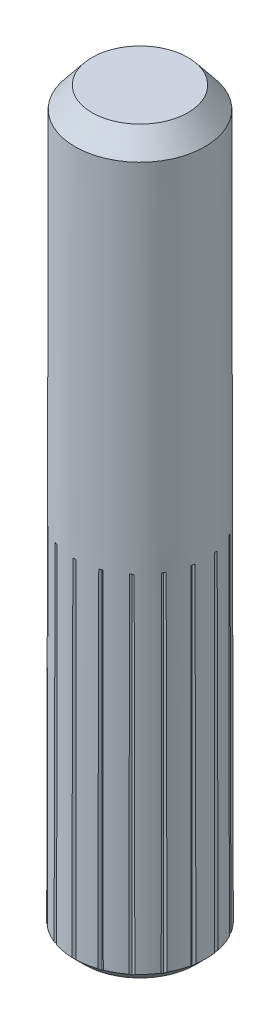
ISO-10303-21;
HEADER;
FILE_DESCRIPTION(('STEP AP214'),'2;1');
FILE_NAME('part.step','',(''),(''),'','','');
FILE_SCHEMA(('AUTOMOTIVE_DESIGN { 1 0 10303 214 1 1 1 1 }'));
ENDSEC;
DATA;
#1=APPLICATION_CONTEXT('core data for automotive mechanical design processes');
#2=APPLICATION_PROTOCOL_DEFINITION('international standard','automotive_design',2000,#1);
#3=PRODUCT_CONTEXT('',#1,'mechanical');
#4=PRODUCT('Part','Part','',(#3));
#5=PRODUCT_RELATED_PRODUCT_CATEGORY('part','',(#4));
#6=PRODUCT_DEFINITION_FORMATION('','',#4);
#7=PRODUCT_DEFINITION_CONTEXT('part definition',#1,'design');
#8=PRODUCT_DEFINITION('design','',#6,#7);
#9=PRODUCT_DEFINITION_SHAPE('','',#8);
#10=(LENGTH_UNIT() NAMED_UNIT(*) SI_UNIT(.MILLI.,.METRE.));
#11=(NAMED_UNIT(*) PLANE_ANGLE_UNIT() SI_UNIT($,.RADIAN.));
#12=(NAMED_UNIT(*) SI_UNIT($,.STERADIAN.) SOLID_ANGLE_UNIT());
#13=UNCERTAINTY_MEASURE_WITH_UNIT(LENGTH_MEASURE(1.E-05),#10,'distance_accuracy_value','');
#14=(GEOMETRIC_REPRESENTATION_CONTEXT(3) GLOBAL_UNCERTAINTY_ASSIGNED_CONTEXT((#13)) GLOBAL_UNIT_ASSIGNED_CONTEXT((#10,
#11,#12)) REPRESENTATION_CONTEXT('',''));
#15=CARTESIAN_POINT('',(0.,0.,0.));
#16=DIRECTION('',(0.,0.,1.));
#17=DIRECTION('',(1.,0.,0.));
#18=AXIS2_PLACEMENT_3D('',#15,#16,#17);
#19=CARTESIAN_POINT('',(0.,0.,0.));
#20=DIRECTION('',(0.,-1.,0.));
#21=DIRECTION('',(0.,0.,1.));
#22=AXIS2_PLACEMENT_3D('',#19,#20,#21);
#23=CONICAL_SURFACE('',#22,3.15,0.0015707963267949);
#24=CARTESIAN_POINT('',(0.,17.,0.));
#25=DIRECTION('',(0.,-1.,0.));
#26=DIRECTION('',(0.,0.,-1.));
#27=AXIS2_PLACEMENT_3D('',#24,#25,#26);
#28=CIRCLE('',#27,3.12329644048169);
#29=CARTESIAN_POINT('',(-0.996697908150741,17.,2.95999559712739));
#30=VERTEX_POINT('',#29);
#31=CARTESIAN_POINT('',(-1.14140363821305,17.,2.90726304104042));
#32=VERTEX_POINT('',#31);
#33=EDGE_CURVE('E11',#30,#32,#28,.T.);
#34=ORIENTED_EDGE('',*,*,#33,.F.);
#35=CARTESIAN_POINT('',(-0.996698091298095,17.0002,2.95999520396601));
#36=CARTESIAN_POINT('',(-0.994794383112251,14.9212730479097,2.96408188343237));
#37=CARTESIAN_POINT('',(-0.992893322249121,12.8423460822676,2.96816287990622));
#38=CARTESIAN_POINT('',(-0.987870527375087,7.34195138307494,2.97894528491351));
#39=CARTESIAN_POINT('',(-0.98475331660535,3.92048362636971,2.98563698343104));
#40=CARTESIAN_POINT('',(-0.981643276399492,0.4990158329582,2.99231328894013));
#41=B_SPLINE_CURVE_WITH_KNOTS('',3,(#35,#36,#37,#38,#39,#40),.UNSPECIFIED.,.F.,.F.,(4,2,4),(0.,
6.23679552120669,16.5012226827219),.UNSPECIFIED.);
#42=CARTESIAN_POINT('',(-0.981643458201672,0.499215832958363,2.99231289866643));
#43=VERTEX_POINT('',#42);
#44=EDGE_CURVE('E394',#30,#43,#41,.T.);
#45=ORIENTED_EDGE('',*,*,#44,.T.);
#46=CARTESIAN_POINT('',(0.,0.4992158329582,0.));
#47=DIRECTION('',(0.,1.,0.));
#48=DIRECTION('',(0.,0.,1.));
#49=AXIS2_PLACEMENT_3D('',#46,#47,#48);
#50=CIRCLE('',#49,3.14921583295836);
#51=CARTESIAN_POINT('',(-0.103445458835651,0.4992158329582,3.14751638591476));
#52=VERTEX_POINT('',#51);
#53=EDGE_CURVE('E431',#43,#52,#50,.T.);
#54=ORIENTED_EDGE('',*,*,#53,.T.);
#55=CARTESIAN_POINT('',(-0.103445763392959,0.4990158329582,3.14751669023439));
#56=CARTESIAN_POINT('',(-0.100253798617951,2.59519572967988,3.14432721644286));
#57=CARTESIAN_POINT('',(-0.097057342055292,4.69137561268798,3.14113325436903));
#58=CARTESIAN_POINT('',(-0.0886580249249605,10.1917703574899,3.13274049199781));
#59=CARTESIAN_POINT('',(-0.0834478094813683,13.5959851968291,3.12753434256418));
#60=CARTESIAN_POINT('',(-0.0782257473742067,17.0002,3.12231635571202));
#61=B_SPLINE_CURVE_WITH_KNOTS('',3,(#55,#56,#57,#58,#59,#60),.UNSPECIFIED.,.F.,.F.,(4,2,4),(0.,
6.28855426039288,16.5012226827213),.UNSPECIFIED.);
#62=CARTESIAN_POINT('',(-0.0782260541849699,17.,3.12231666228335));
#63=VERTEX_POINT('',#62);
#64=EDGE_CURVE('E1302',#52,#63,#61,.T.);
#65=ORIENTED_EDGE('',*,*,#64,.T.);
#66=CARTESIAN_POINT('',(0.,17.,0.));
#67=DIRECTION('',(0.,-1.,0.));
#68=DIRECTION('',(0.,0.,-1.));
#69=AXIS2_PLACEMENT_3D('',#66,#67,#68);
#70=CIRCLE('',#69,3.12329644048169);
#71=CARTESIAN_POINT('',(0.075788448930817,17.,3.12237678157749));
#72=VERTEX_POINT('',#71);
#73=EDGE_CURVE('E1281',#72,#63,#70,.T.);
#74=ORIENTED_EDGE('',*,*,#73,.F.);
#75=CARTESIAN_POINT('',(0.0757881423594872,17.0002,3.12237647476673));
#76=CARTESIAN_POINT('',(0.0789747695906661,14.9212730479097,3.12556559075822));
#77=CARTESIAN_POINT('',(0.0821569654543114,12.8423460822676,3.12875027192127));
#78=CARTESIAN_POINT('',(0.0905646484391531,7.34195138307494,3.13716452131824));
#79=CARTESIAN_POINT('',(0.0957825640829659,3.9204836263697,3.14238651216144));
#80=CARTESIAN_POINT('',(0.100988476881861,0.499015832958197,3.14759649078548));
#81=B_SPLINE_CURVE_WITH_KNOTS('',3,(#75,#76,#77,#78,#79,#80),.UNSPECIFIED.,.F.,.F.,(4,2,4),(0.,
6.23679552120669,16.5012226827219),.UNSPECIFIED.);
#82=CARTESIAN_POINT('',(0.100988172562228,0.499215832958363,3.14759618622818));
#83=VERTEX_POINT('',#82);
#84=EDGE_CURVE('E1308',#72,#83,#81,.T.);
#85=ORIENTED_EDGE('',*,*,#84,.T.);
#86=CARTESIAN_POINT('',(0.979307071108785,0.4992158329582,2.99307835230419));
#87=VERTEX_POINT('',#86);
#88=EDGE_CURVE('E441',#83,#87,#50,.T.);
#89=ORIENTED_EDGE('',*,*,#88,.T.);
#90=CARTESIAN_POINT('',(0.979306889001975,0.4990158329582,2.99307874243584));
#91=CARTESIAN_POINT('',(0.981215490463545,2.59519572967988,2.9889899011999));
#92=CARTESIAN_POINT('',(0.98312677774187,4.69137561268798,2.98489530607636));
#93=CARTESIAN_POINT('',(0.988149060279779,10.1917703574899,2.97413595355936));
#94=CARTESIAN_POINT('',(0.991264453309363,13.5959851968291,2.96746177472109));
#95=CARTESIAN_POINT('',(0.994386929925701,17.0002,2.96077242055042));
#96=B_SPLINE_CURVE_WITH_KNOTS('',3,(#90,#91,#92,#93,#94,#95),.UNSPECIFIED.,.F.,.F.,(4,2,4),(0.,
6.28855426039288,16.5012226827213),.UNSPECIFIED.);
#97=CARTESIAN_POINT('',(0.994386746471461,17.,2.96077281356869));
#98=VERTEX_POINT('',#97);
#99=EDGE_CURVE('E1253',#87,#98,#96,.T.);
#100=ORIENTED_EDGE('',*,*,#99,.T.);
#101=CARTESIAN_POINT('',(0.,17.,0.));
#102=DIRECTION('',(0.,-1.,0.));
#103=DIRECTION('',(0.,0.,-1.));
#104=AXIS2_PLACEMENT_3D('',#101,#102,#103);
#105=CIRCLE('',#104,3.12329644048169);
#106=CARTESIAN_POINT('',(1.13913360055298,17.,2.90815324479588));
#107=VERTEX_POINT('',#106);
#108=EDGE_CURVE('E1232',#107,#98,#105,.T.);
#109=ORIENTED_EDGE('',*,*,#108,.F.);
#110=CARTESIAN_POINT('',(1.1391332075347,17.0002,2.90815306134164));
#111=CARTESIAN_POINT('',(1.14321839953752,14.9212730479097,2.91005995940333));
#112=CARTESIAN_POINT('',(1.14729791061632,12.8423460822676,2.91196420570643));
#113=CARTESIAN_POINT('',(1.15807639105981,7.34195138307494,2.9169954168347));
#114=CARTESIAN_POINT('',(1.16476565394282,3.9204836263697,2.92011785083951));
#115=CARTESIAN_POINT('',(1.17143952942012,0.499015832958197,2.92323310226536));
#116=B_SPLINE_CURVE_WITH_KNOTS('',3,(#110,#111,#112,#113,#114,#115),.UNSPECIFIED.,.F.,.F.,(4,2,
4),(0.,6.23679552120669,16.5012226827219),.UNSPECIFIED.);
#117=CARTESIAN_POINT('',(1.17143913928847,0.499215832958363,2.92323292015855));
#118=VERTEX_POINT('',#117);
#119=EDGE_CURVE('E1259',#107,#118,#116,.T.);
#120=ORIENTED_EDGE('',*,*,#119,.T.);
#121=CARTESIAN_POINT('',(1.94394071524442,0.4992158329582,2.47763089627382));
#122=VERTEX_POINT('',#121);
#123=EDGE_CURVE('E450',#118,#122,#50,.T.);
#124=ORIENTED_EDGE('',*,*,#123,.T.);
#125=CARTESIAN_POINT('',(1.94394067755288,0.4990158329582,2.47763132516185));
#126=CARTESIAN_POINT('',(1.94433571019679,2.59519572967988,2.47313629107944));
#127=CARTESIAN_POINT('',(1.94473129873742,4.69137561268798,2.46863493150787));
#128=CARTESIAN_POINT('',(1.94577078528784,10.1917703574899,2.45680672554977));
#129=CARTESIAN_POINT('',(1.94641559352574,13.5959851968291,2.44946952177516));
#130=CARTESIAN_POINT('',(1.94706186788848,17.0002,2.4421156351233));
#131=B_SPLINE_CURVE_WITH_KNOTS('',3,(#125,#126,#127,#128,#129,#130),.UNSPECIFIED.,.F.,.F.,(4,2,
4),(0.,6.28855426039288,16.5012226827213),.UNSPECIFIED.);
#132=CARTESIAN_POINT('',(1.94706182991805,17.,2.44211606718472));
#133=VERTEX_POINT('',#132);
#134=EDGE_CURVE('E1204',#122,#133,#131,.T.);
#135=ORIENTED_EDGE('',*,*,#134,.T.);
#136=CARTESIAN_POINT('',(0.,17.,0.));
#137=DIRECTION('',(0.,-1.,0.));
#138=DIRECTION('',(0.,0.,-1.));
#139=AXIS2_PLACEMENT_3D('',#136,#137,#138);
#140=CIRCLE('',#139,3.12329644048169);
#141=CARTESIAN_POINT('',(2.06508242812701,17.,2.34316350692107));
#142=VERTEX_POINT('',#141);
#143=EDGE_CURVE('E1183',#142,#133,#140,.T.);
#144=ORIENTED_EDGE('',*,*,#143,.F.);
#145=CARTESIAN_POINT('',(2.06508199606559,17.0002,2.34316346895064));
#146=CARTESIAN_POINT('',(2.06957301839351,14.9212730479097,2.34355814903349));
#147=CARTESIAN_POINT('',(2.07405779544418,12.8423460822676,2.3439522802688));
#148=CARTESIAN_POINT('',(2.08590702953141,7.34195138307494,2.34499361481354));
#149=CARTESIAN_POINT('',(2.09326081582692,3.9204836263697,2.34563988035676));
#150=CARTESIAN_POINT('',(2.10059768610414,0.499015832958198,2.34628465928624));
#151=B_SPLINE_CURVE_WITH_KNOTS('',3,(#145,#146,#147,#148,#149,#150),.UNSPECIFIED.,.F.,.F.,(4,2,
4),(0.,6.23679552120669,16.5012226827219),.UNSPECIFIED.);
#152=CARTESIAN_POINT('',(2.10059725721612,0.499215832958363,2.34628462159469));
#153=VERTEX_POINT('',#152);
#154=EDGE_CURVE('E1210',#142,#153,#151,.T.);
#155=ORIENTED_EDGE('',*,*,#154,.T.);
#156=CARTESIAN_POINT('',(2.67410641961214,0.4992158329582,1.66334458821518));
#157=VERTEX_POINT('',#156);
#158=EDGE_CURVE('E456',#153,#157,#50,.T.);
#159=ORIENTED_EDGE('',*,*,#158,.T.);
#160=CARTESIAN_POINT('',(2.67410653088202,0.4990158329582,1.66334500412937));
#161=CARTESIAN_POINT('',(2.67294034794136,2.59519572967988,1.65898594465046));
#162=CARTESIAN_POINT('',(2.67177252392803,4.69137561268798,1.65462075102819));
#163=CARTESIAN_POINT('',(2.66870383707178,10.1917703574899,1.64315034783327));
#164=CARTESIAN_POINT('',(2.66680028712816,13.5959851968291,1.63603509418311));
#165=CARTESIAN_POINT('',(2.66489240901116,17.0002,1.62890366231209));
#166=B_SPLINE_CURVE_WITH_KNOTS('',3,(#160,#161,#162,#163,#164,#165),.UNSPECIFIED.,.F.,.F.,(4,2,
4),(0.,6.28855426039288,16.5012226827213),.UNSPECIFIED.);
#167=CARTESIAN_POINT('',(2.66489252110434,17.,1.62890408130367));
#168=VERTEX_POINT('',#167);
#169=EDGE_CURVE('E1155',#157,#168,#166,.T.);
#170=ORIENTED_EDGE('',*,*,#169,.T.);
#171=CARTESIAN_POINT('',(0.,17.,0.));
#172=DIRECTION('',(0.,-1.,0.));
#173=DIRECTION('',(0.,0.,-1.));
#174=AXIS2_PLACEMENT_3D('',#171,#172,#173);
#175=CIRCLE('',#174,3.12329644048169);
#176=CARTESIAN_POINT('',(2.74195183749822,17.,1.49555366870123));
#177=VERTEX_POINT('',#176);
#178=EDGE_CURVE('E1134',#177,#168,#175,.T.);
#179=ORIENTED_EDGE('',*,*,#178,.F.);
#180=CARTESIAN_POINT('',(2.74195141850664,17.0002,1.49555378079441));
#181=CARTESIAN_POINT('',(2.74630658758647,14.9212730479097,1.49438863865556));
#182=CARTESIAN_POINT('',(2.75065570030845,12.8423460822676,1.49322511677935));
#183=CARTESIAN_POINT('',(2.76214649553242,7.34195138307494,1.490150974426));
#184=CARTESIAN_POINT('',(2.76927783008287,3.9204836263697,1.48824312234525));
#185=CARTESIAN_POINT('',(2.77639276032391,0.499015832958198,1.48633965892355));
#186=B_SPLINE_CURVE_WITH_KNOTS('',3,(#180,#181,#182,#183,#184,#185),.UNSPECIFIED.,.F.,.F.,(4,2,
4),(0.,6.23679552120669,16.5012226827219),.UNSPECIFIED.);
#187=CARTESIAN_POINT('',(2.77639234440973,0.499215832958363,1.48633977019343));
#188=VERTEX_POINT('',#187);
#189=EDGE_CURVE('E1161',#177,#188,#186,.T.);
#190=ORIENTED_EDGE('',*,*,#189,.T.);
#191=CARTESIAN_POINT('',(3.08173542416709,0.4992158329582,0.648434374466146));
#192=VERTEX_POINT('',#191);
#193=EDGE_CURVE('E461',#188,#192,#50,.T.);
#194=ORIENTED_EDGE('',*,*,#193,.T.);
#195=CARTESIAN_POINT('',(3.0817356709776,0.4990158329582,0.648434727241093));
#196=CARTESIAN_POINT('',(3.07914893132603,2.59519572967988,0.644737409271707));
#197=CARTESIAN_POINT('',(3.07655855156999,4.69137561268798,0.641034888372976));
#198=CARTESIAN_POINT('',(3.06975182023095,10.1917703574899,0.631305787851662));
#199=CARTESIAN_POINT('',(3.0655295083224,13.5959851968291,0.625270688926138));
#200=CARTESIAN_POINT('',(3.06129759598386,17.0002,0.619221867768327));
#201=B_SPLINE_CURVE_WITH_KNOTS('',3,(#195,#196,#197,#198,#199,#200),.UNSPECIFIED.,.F.,.F.,(4,2,
4),(0.,6.28855426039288,16.5012226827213),.UNSPECIFIED.);
#202=CARTESIAN_POINT('',(3.06129784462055,17.,0.619222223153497));
#203=VERTEX_POINT('',#202);
#204=EDGE_CURVE('E1106',#192,#203,#201,.T.);
#205=ORIENTED_EDGE('',*,*,#204,.T.);
#206=CARTESIAN_POINT('',(0.,17.,0.));
#207=DIRECTION('',(0.,-1.,0.));
#208=DIRECTION('',(0.,0.,-1.));
#209=AXIS2_PLACEMENT_3D('',#206,#207,#208);
#210=CIRCLE('',#209,3.12329644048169);
#211=CARTESIAN_POINT('',(3.08810138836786,17.,0.467557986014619));
#212=VERTEX_POINT('',#211);
#213=EDGE_CURVE('E1085',#212,#203,#210,.T.);
#214=ORIENTED_EDGE('',*,*,#213,.F.);
#215=CARTESIAN_POINT('',(3.08810103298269,17.0002,0.467558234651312));
#216=CARTESIAN_POINT('',(3.09179505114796,14.9212730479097,0.464973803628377));
#217=CARTESIAN_POINT('',(3.09548393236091,12.8423460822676,0.46239296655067));
#218=CARTESIAN_POINT('',(3.10523032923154,7.34195138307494,0.455574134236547));
#219=CARTESIAN_POINT('',(3.11127906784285,3.9204836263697,0.451342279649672));
#220=CARTESIAN_POINT('',(3.11731389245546,0.499015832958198,0.447120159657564));
#221=B_SPLINE_CURVE_WITH_KNOTS('',3,(#215,#216,#217,#218,#219,#220),.UNSPECIFIED.,.F.,.F.,(4,2,
4),(0.,6.23679552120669,16.5012226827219),.UNSPECIFIED.);
#222=CARTESIAN_POINT('',(3.11731353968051,0.499215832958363,0.447120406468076));
#223=VERTEX_POINT('',#222);
#224=EDGE_CURVE('E1112',#212,#223,#221,.T.);
#225=ORIENTED_EDGE('',*,*,#224,.T.);
#226=CARTESIAN_POINT('',(3.11766165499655,0.4992158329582,-0.444686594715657));
#227=VERTEX_POINT('',#226);
#228=EDGE_CURVE('E466',#223,#227,#50,.T.);
#229=ORIENTED_EDGE('',*,*,#228,.T.);
#230=CARTESIAN_POINT('',(3.1176620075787,0.4990158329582,-0.44468634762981));
#231=CARTESIAN_POINT('',(3.11396671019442,2.59519572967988,-0.447275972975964));
#232=CARTESIAN_POINT('',(3.11026621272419,4.69137561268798,-0.449869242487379));
#233=CARTESIAN_POINT('',(3.10054242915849,10.1917703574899,-0.456683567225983));
#234=CARTESIAN_POINT('',(3.09451062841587,13.5959851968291,-0.460910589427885));
#235=CARTESIAN_POINT('',(3.08846511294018,17.0002,-0.465147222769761));
#236=B_SPLINE_CURVE_WITH_KNOTS('',3,(#230,#231,#232,#233,#234,#235),.UNSPECIFIED.,.F.,.F.,(4,2,
4),(0.,6.28855426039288,16.5012226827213),.UNSPECIFIED.);
#237=CARTESIAN_POINT('',(3.08846546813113,17.,-0.465146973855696));
#238=VERTEX_POINT('',#237);
#239=EDGE_CURVE('E1057',#227,#238,#236,.T.);
#240=ORIENTED_EDGE('',*,*,#239,.T.);
#241=CARTESIAN_POINT('',(0.,17.,0.));
#242=DIRECTION('',(0.,-1.,0.));
#243=DIRECTION('',(0.,0.,-1.));
#244=AXIS2_PLACEMENT_3D('',#241,#242,#243);
#245=CIRCLE('',#244,3.12329644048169);
#246=CARTESIAN_POINT('',(3.06178033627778,17.,-0.616832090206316));
#247=VERTEX_POINT('',#246);
#248=EDGE_CURVE('E1036',#247,#238,#245,.T.);
#249=ORIENTED_EDGE('',*,*,#248,.F.);
#250=CARTESIAN_POINT('',(3.06178008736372,17.0002,-0.616831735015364));
#251=CARTESIAN_POINT('',(3.06436740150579,14.9212730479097,-0.620523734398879));
#252=CARTESIAN_POINT('',(3.06695111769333,12.8423460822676,-0.624210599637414));
#253=CARTESIAN_POINT('',(3.07377755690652,7.34195138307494,-0.633951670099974));
#254=CARTESIAN_POINT('',(3.0780141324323,3.92048362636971,-0.63999710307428));
#255=CARTESIAN_POINT('',(3.08224096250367,0.4990158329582,-0.646028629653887));
#256=B_SPLINE_CURVE_WITH_KNOTS('',3,(#250,#251,#252,#253,#254,#255),.UNSPECIFIED.,.F.,.F.,(4,2,
4),(0.,6.23679552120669,16.5012226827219),.UNSPECIFIED.);
#257=CARTESIAN_POINT('',(3.08224071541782,0.499215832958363,-0.646028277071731));
#258=VERTEX_POINT('',#257);
#259=EDGE_CURVE('E1063',#247,#258,#256,.T.);
#260=ORIENTED_EDGE('',*,*,#259,.T.);
#261=CARTESIAN_POINT('',(2.77755187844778,0.4992158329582,-1.48417179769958));
#262=VERTEX_POINT('',#261);
#263=EDGE_CURVE('E471',#258,#262,#50,.T.);
#264=ORIENTED_EDGE('',*,*,#263,.T.);
#265=CARTESIAN_POINT('',(2.77755229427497,0.4990158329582,-1.48417168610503));
#266=CARTESIAN_POINT('',(2.7731941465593,2.59519572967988,-1.48534127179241));
#267=CARTESIAN_POINT('',(2.76882986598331,4.69137561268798,-1.48651250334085));
#268=CARTESIAN_POINT('',(2.75736186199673,10.1917703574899,-1.48959014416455));
#269=CARTESIAN_POINT('',(2.75024809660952,13.5959851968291,-1.49149924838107));
#270=CARTESIAN_POINT('',(2.74311815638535,17.0002,-1.49341269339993));
#271=B_SPLINE_CURVE_WITH_KNOTS('',3,(#265,#266,#267,#268,#269,#270),.UNSPECIFIED.,.F.,.F.,(4,2,
4),(0.,6.28855426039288,16.5012226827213),.UNSPECIFIED.);
#272=CARTESIAN_POINT('',(2.74311857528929,17.,-1.49341258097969));
#273=VERTEX_POINT('',#272);
#274=EDGE_CURVE('E1008',#262,#273,#271,.T.);
#275=ORIENTED_EDGE('',*,*,#274,.T.);
#276=CARTESIAN_POINT('',(0.,17.,0.));
#277=DIRECTION('',(0.,-1.,0.));
#278=DIRECTION('',(0.,0.,-1.));
#279=AXIS2_PLACEMENT_3D('',#276,#277,#278);
#280=CIRCLE('',#279,3.12329644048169);
#281=CARTESIAN_POINT('',(2.66616338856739,17.,-1.62682311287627));
#282=VERTEX_POINT('',#281);
#283=EDGE_CURVE('E987',#282,#273,#280,.T.);
#284=ORIENTED_EDGE('',*,*,#283,.F.);
#285=CARTESIAN_POINT('',(2.66616327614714,17.0002,-1.62682269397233));
#286=CARTESIAN_POINT('',(2.66733181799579,14.9212730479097,-1.63117695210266));
#287=CARTESIAN_POINT('',(2.66849873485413,12.8423460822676,-1.63552515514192));
#288=CARTESIAN_POINT('',(2.67158184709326,7.34195138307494,-1.64701354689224));
#289=CARTESIAN_POINT('',(2.67349526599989,3.92048362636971,-1.65414338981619));
#290=CARTESIAN_POINT('',(2.67540428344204,0.4990158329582,-1.66125683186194));
#291=B_SPLINE_CURVE_WITH_KNOTS('',3,(#285,#286,#287,#288,#289,#290),.UNSPECIFIED.,.F.,.F.,(4,2,
4),(0.,6.23679552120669,16.5012226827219),.UNSPECIFIED.);
#292=CARTESIAN_POINT('',(2.67540417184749,0.499215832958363,-1.66125641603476));
#293=VERTEX_POINT('',#292);
#294=EDGE_CURVE('E1014',#282,#293,#291,.T.);
#295=ORIENTED_EDGE('',*,*,#294,.T.);
#296=CARTESIAN_POINT('',(2.10242835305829,0.4992158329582,-2.34464397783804));
#297=VERTEX_POINT('',#296);
#298=EDGE_CURVE('E476',#293,#297,#50,.T.);
#299=ORIENTED_EDGE('',*,*,#298,.T.);
#300=CARTESIAN_POINT('',(2.10242878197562,0.4990158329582,-2.34464401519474));
#301=CARTESIAN_POINT('',(2.09793344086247,2.59519572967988,-2.3442524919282));
#302=CARTESIAN_POINT('',(2.09343177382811,4.69137561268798,-2.34386041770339));
#303=CARTESIAN_POINT('',(2.08160275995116,10.1917703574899,-2.3428301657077));
#304=CARTESIAN_POINT('',(2.07426505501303,13.5959851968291,-2.34219108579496));
#305=CARTESIAN_POINT('',(2.06691066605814,17.0002,-2.34155055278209));
#306=B_SPLINE_CURVE_WITH_KNOTS('',3,(#300,#301,#302,#303,#304,#305),.UNSPECIFIED.,.F.,.F.,(4,2,
4),(0.,6.28855426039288,16.5012226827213),.UNSPECIFIED.);
#307=CARTESIAN_POINT('',(2.06691109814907,17.,-2.3415505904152));
#308=VERTEX_POINT('',#307);
#309=EDGE_CURVE('E959',#297,#308,#306,.T.);
#310=ORIENTED_EDGE('',*,*,#309,.T.);
#311=CARTESIAN_POINT('',(0.,17.,0.));
#312=DIRECTION('',(0.,-1.,0.));
#313=DIRECTION('',(0.,0.,-1.));
#314=AXIS2_PLACEMENT_3D('',#311,#312,#313);
#315=CIRCLE('',#314,3.12329644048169);
#316=CARTESIAN_POINT('',(1.94896778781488,17.,-2.44059525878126));
#317=VERTEX_POINT('',#316);
#318=EDGE_CURVE('E938',#317,#308,#315,.T.);
#319=ORIENTED_EDGE('',*,*,#318,.F.);
#320=CARTESIAN_POINT('',(1.94896782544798,17.0002,-2.44059482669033));
#321=CARTESIAN_POINT('',(1.94857665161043,14.9212730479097,-2.44508615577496));
#322=CARTESIAN_POINT('',(1.94818602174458,12.8423460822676,-2.44957123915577));
#323=CARTESIAN_POINT('',(1.94715393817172,7.34195138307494,-2.46142128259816));
#324=CARTESIAN_POINT('',(1.94651341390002,3.92048362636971,-2.46877557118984));
#325=CARTESIAN_POINT('',(1.94587436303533,0.4990158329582,-2.4761129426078));
#326=B_SPLINE_CURVE_WITH_KNOTS('',3,(#320,#321,#322,#323,#324,#325),.UNSPECIFIED.,.F.,.F.,(4,2,
4),(0.,6.23679552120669,16.5012226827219),.UNSPECIFIED.);
#327=CARTESIAN_POINT('',(1.94587440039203,0.499215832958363,-2.47611251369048));
#328=VERTEX_POINT('',#327);
#329=EDGE_CURVE('E965',#317,#328,#326,.T.);
#330=ORIENTED_EDGE('',*,*,#329,.T.);
#331=CARTESIAN_POINT('',(1.17372093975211,0.4992158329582,-2.92231749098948));
#332=VERTEX_POINT('',#331);
#333=EDGE_CURVE('E481',#328,#332,#50,.T.);
#334=ORIENTED_EDGE('',*,*,#333,.T.);
#335=CARTESIAN_POINT('',(1.17372133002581,0.499015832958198,-2.92231767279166));
#336=CARTESIAN_POINT('',(1.16963099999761,2.59519572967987,-2.9204122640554));
#337=CARTESIAN_POINT('',(1.16553491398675,4.69137561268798,-2.91850417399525));
#338=CARTESIAN_POINT('',(1.15477164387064,10.1917703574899,-2.91349029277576));
#339=CARTESIAN_POINT('',(1.14809503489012,13.5959851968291,-2.91038011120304));
#340=CARTESIAN_POINT('',(1.14140324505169,17.0002,-2.90726285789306));
#341=B_SPLINE_CURVE_WITH_KNOTS('',3,(#335,#336,#337,#338,#339,#340),.UNSPECIFIED.,.F.,.F.,(4,2,
4),(0.,6.28855426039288,16.5012226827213),.UNSPECIFIED.);
#342=CARTESIAN_POINT('',(1.14140363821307,17.,-2.90726304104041));
#343=VERTEX_POINT('',#342);
#344=EDGE_CURVE('E910',#332,#343,#341,.T.);
#345=ORIENTED_EDGE('',*,*,#344,.T.);
#346=CARTESIAN_POINT('',(0.,17.,0.));
#347=DIRECTION('',(0.,-1.,0.));
#348=DIRECTION('',(0.,0.,-1.));
#349=AXIS2_PLACEMENT_3D('',#346,#347,#348);
#350=CIRCLE('',#349,3.12329644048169);
#351=CARTESIAN_POINT('',(0.99669790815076,17.,-2.95999559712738));
#352=VERTEX_POINT('',#351);
#353=EDGE_CURVE('E889',#352,#343,#350,.T.);
#354=ORIENTED_EDGE('',*,*,#353,.F.);
#355=CARTESIAN_POINT('',(0.996698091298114,17.0002,-2.959995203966));
#356=CARTESIAN_POINT('',(0.994794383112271,14.9212730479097,-2.96408188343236));
#357=CARTESIAN_POINT('',(0.99289332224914,12.8423460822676,-2.96816287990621));
#358=CARTESIAN_POINT('',(0.987870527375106,7.34195138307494,-2.97894528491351));
#359=CARTESIAN_POINT('',(0.984753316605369,3.92048362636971,-2.98563698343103));
#360=CARTESIAN_POINT('',(0.981643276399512,0.4990158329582,-2.99231328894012));
#361=B_SPLINE_CURVE_WITH_KNOTS('',3,(#355,#356,#357,#358,#359,#360),.UNSPECIFIED.,.F.,.F.,(4,2,
4),(0.,6.23679552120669,16.5012226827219),.UNSPECIFIED.);
#362=CARTESIAN_POINT('',(0.981643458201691,0.499215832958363,-2.99231289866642));
#363=VERTEX_POINT('',#362);
#364=EDGE_CURVE('E916',#352,#363,#361,.T.);
#365=ORIENTED_EDGE('',*,*,#364,.T.);
#366=CARTESIAN_POINT('',(0.103445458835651,0.4992158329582,-3.14751638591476));
#367=VERTEX_POINT('',#366);
#368=EDGE_CURVE('E486',#363,#367,#50,.T.);
#369=ORIENTED_EDGE('',*,*,#368,.T.);
#370=CARTESIAN_POINT('',(0.103445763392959,0.4990158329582,-3.14751669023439));
#371=CARTESIAN_POINT('',(0.100253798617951,2.59519572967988,-3.14432721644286));
#372=CARTESIAN_POINT('',(0.097057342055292,4.69137561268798,-3.14113325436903));
#373=CARTESIAN_POINT('',(0.0886580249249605,10.1917703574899,-3.13274049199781));
#374=CARTESIAN_POINT('',(0.0834478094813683,13.5959851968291,-3.12753434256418));
#375=CARTESIAN_POINT('',(0.0782257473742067,17.0002,-3.12231635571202));
#376=B_SPLINE_CURVE_WITH_KNOTS('',3,(#370,#371,#372,#373,#374,#375),.UNSPECIFIED.,.F.,.F.,(4,2,
4),(0.,6.28855426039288,16.5012226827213),.UNSPECIFIED.);
#377=CARTESIAN_POINT('',(0.0782260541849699,17.,-3.12231666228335));
#378=VERTEX_POINT('',#377);
#379=EDGE_CURVE('E861',#367,#378,#376,.T.);
#380=ORIENTED_EDGE('',*,*,#379,.T.);
#381=CARTESIAN_POINT('',(0.,17.,0.));
#382=DIRECTION('',(0.,-1.,0.));
#383=DIRECTION('',(0.,0.,-1.));
#384=AXIS2_PLACEMENT_3D('',#381,#382,#383);
#385=CIRCLE('',#384,3.12329644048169);
#386=CARTESIAN_POINT('',(-0.075788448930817,17.,-3.12237678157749));
#387=VERTEX_POINT('',#386);
#388=EDGE_CURVE('E840',#387,#378,#385,.T.);
#389=ORIENTED_EDGE('',*,*,#388,.F.);
#390=CARTESIAN_POINT('',(-0.0757881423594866,17.0002,-3.12237647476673));
#391=CARTESIAN_POINT('',(-0.0789747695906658,14.9212730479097,-3.12556559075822));
#392=CARTESIAN_POINT('',(-0.0821569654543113,12.8423460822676,-3.12875027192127));
#393=CARTESIAN_POINT('',(-0.0905646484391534,7.34195138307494,-3.13716452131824));
#394=CARTESIAN_POINT('',(-0.0957825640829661,3.9204836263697,-3.14238651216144));
#395=CARTESIAN_POINT('',(-0.100988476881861,0.499015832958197,-3.14759649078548));
#396=B_SPLINE_CURVE_WITH_KNOTS('',3,(#390,#391,#392,#393,#394,#395),.UNSPECIFIED.,.F.,.F.,(4,2,
4),(0.,6.23679552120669,16.5012226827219),.UNSPECIFIED.);
#397=CARTESIAN_POINT('',(-0.100988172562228,0.499215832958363,-3.14759618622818));
#398=VERTEX_POINT('',#397);
#399=EDGE_CURVE('E867',#387,#398,#396,.T.);
#400=ORIENTED_EDGE('',*,*,#399,.T.);
#401=CARTESIAN_POINT('',(-0.979307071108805,0.4992158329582,-2.99307835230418));
#402=VERTEX_POINT('',#401);
#403=EDGE_CURVE('E491',#398,#402,#50,.T.);
#404=ORIENTED_EDGE('',*,*,#403,.T.);
#405=CARTESIAN_POINT('',(-0.979306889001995,0.4990158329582,-2.99307874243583));
#406=CARTESIAN_POINT('',(-0.981215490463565,2.59519572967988,-2.9889899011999));
#407=CARTESIAN_POINT('',(-0.983126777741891,4.69137561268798,-2.98489530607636));
#408=CARTESIAN_POINT('',(-0.9881490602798,10.1917703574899,-2.97413595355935));
#409=CARTESIAN_POINT('',(-0.991264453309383,13.5959851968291,-2.96746177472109));
#410=CARTESIAN_POINT('',(-0.994386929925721,17.0002,-2.96077242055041));
#411=B_SPLINE_CURVE_WITH_KNOTS('',3,(#405,#406,#407,#408,#409,#410),.UNSPECIFIED.,.F.,.F.,(4,2,
4),(0.,6.28855426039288,16.5012226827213),.UNSPECIFIED.);
#412=CARTESIAN_POINT('',(-0.994386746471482,17.,-2.96077281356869));
#413=VERTEX_POINT('',#412);
#414=EDGE_CURVE('E812',#402,#413,#411,.T.);
#415=ORIENTED_EDGE('',*,*,#414,.T.);
#416=CARTESIAN_POINT('',(0.,17.,0.));
#417=DIRECTION('',(0.,-1.,0.));
#418=DIRECTION('',(0.,0.,-1.));
#419=AXIS2_PLACEMENT_3D('',#416,#417,#418);
#420=CIRCLE('',#419,3.12329644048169);
#421=CARTESIAN_POINT('',(-1.13913360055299,17.,-2.90815324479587));
#422=VERTEX_POINT('',#421);
#423=EDGE_CURVE('E791',#422,#413,#420,.T.);
#424=ORIENTED_EDGE('',*,*,#423,.F.);
#425=CARTESIAN_POINT('',(-1.13913320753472,17.0002,-2.90815306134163));
#426=CARTESIAN_POINT('',(-1.14321839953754,14.9212730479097,-2.91005995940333));
#427=CARTESIAN_POINT('',(-1.14729791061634,12.8423460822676,-2.91196420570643));
#428=CARTESIAN_POINT('',(-1.15807639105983,7.34195138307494,-2.9169954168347));
#429=CARTESIAN_POINT('',(-1.16476565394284,3.9204836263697,-2.92011785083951));
#430=CARTESIAN_POINT('',(-1.17143952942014,0.499015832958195,-2.92323310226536));
#431=B_SPLINE_CURVE_WITH_KNOTS('',3,(#425,#426,#427,#428,#429,#430),.UNSPECIFIED.,.F.,.F.,(4,2,
4),(0.,6.23679552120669,16.5012226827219),.UNSPECIFIED.);
#432=CARTESIAN_POINT('',(-1.17143913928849,0.499215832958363,-2.92323292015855));
#433=VERTEX_POINT('',#432);
#434=EDGE_CURVE('E818',#422,#433,#431,.T.);
#435=ORIENTED_EDGE('',*,*,#434,.T.);
#436=CARTESIAN_POINT('',(-1.94394071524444,0.4992158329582,-2.47763089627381));
#437=VERTEX_POINT('',#436);
#438=EDGE_CURVE('E496',#433,#437,#50,.T.);
#439=ORIENTED_EDGE('',*,*,#438,.T.);
#440=CARTESIAN_POINT('',(-1.9439406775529,0.4990158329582,-2.47763132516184));
#441=CARTESIAN_POINT('',(-1.94433571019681,2.59519572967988,-2.47313629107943));
#442=CARTESIAN_POINT('',(-1.94473129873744,4.69137561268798,-2.46863493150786));
#443=CARTESIAN_POINT('',(-1.94577078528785,10.1917703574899,-2.45680672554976));
#444=CARTESIAN_POINT('',(-1.94641559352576,13.5959851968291,-2.44946952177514));
#445=CARTESIAN_POINT('',(-1.94706186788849,17.0002,-2.44211563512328));
#446=B_SPLINE_CURVE_WITH_KNOTS('',3,(#440,#441,#442,#443,#444,#445),.UNSPECIFIED.,.F.,.F.,(4,2,
4),(0.,6.28855426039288,16.5012226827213),.UNSPECIFIED.);
#447=CARTESIAN_POINT('',(-1.94706182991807,17.,-2.4421160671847));
#448=VERTEX_POINT('',#447);
#449=EDGE_CURVE('E763',#437,#448,#446,.T.);
#450=ORIENTED_EDGE('',*,*,#449,.T.);
#451=CARTESIAN_POINT('',(0.,17.,0.));
#452=DIRECTION('',(0.,-1.,0.));
#453=DIRECTION('',(0.,0.,-1.));
#454=AXIS2_PLACEMENT_3D('',#451,#452,#453);
#455=CIRCLE('',#454,3.12329644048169);
#456=CARTESIAN_POINT('',(-2.06508242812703,17.,-2.34316350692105));
#457=VERTEX_POINT('',#456);
#458=EDGE_CURVE('E742',#457,#448,#455,.T.);
#459=ORIENTED_EDGE('',*,*,#458,.F.);
#460=CARTESIAN_POINT('',(-2.0650819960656,17.0002,-2.34316346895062));
#461=CARTESIAN_POINT('',(-2.06957301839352,14.9212730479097,-2.34355814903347));
#462=CARTESIAN_POINT('',(-2.07405779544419,12.8423460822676,-2.34395228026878));
#463=CARTESIAN_POINT('',(-2.08590702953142,7.34195138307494,-2.34499361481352));
#464=CARTESIAN_POINT('',(-2.09326081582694,3.9204836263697,-2.34563988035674));
#465=CARTESIAN_POINT('',(-2.10059768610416,0.499015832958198,-2.34628465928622));
#466=B_SPLINE_CURVE_WITH_KNOTS('',3,(#460,#461,#462,#463,#464,#465),.UNSPECIFIED.,.F.,.F.,(4,2,
4),(0.,6.23679552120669,16.5012226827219),.UNSPECIFIED.);
#467=CARTESIAN_POINT('',(-2.10059725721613,0.499215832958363,-2.34628462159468));
#468=VERTEX_POINT('',#467);
#469=EDGE_CURVE('E769',#457,#468,#466,.T.);
#470=ORIENTED_EDGE('',*,*,#469,.T.);
#471=CARTESIAN_POINT('',(-2.67410641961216,0.4992158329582,-1.66334458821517));
#472=VERTEX_POINT('',#471);
#473=EDGE_CURVE('E501',#468,#472,#50,.T.);
#474=ORIENTED_EDGE('',*,*,#473,.T.);
#475=CARTESIAN_POINT('',(-2.67410653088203,0.4990158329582,-1.66334500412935));
#476=CARTESIAN_POINT('',(-2.67294034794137,2.59519572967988,-1.65898594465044));
#477=CARTESIAN_POINT('',(-2.67177252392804,4.69137561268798,-1.65462075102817));
#478=CARTESIAN_POINT('',(-2.6687038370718,10.1917703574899,-1.64315034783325));
#479=CARTESIAN_POINT('',(-2.66680028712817,13.5959851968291,-1.63603509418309));
#480=CARTESIAN_POINT('',(-2.66489240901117,17.0002,-1.62890366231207));
#481=B_SPLINE_CURVE_WITH_KNOTS('',3,(#475,#476,#477,#478,#479,#480),.UNSPECIFIED.,.F.,.F.,(4,2,
4),(0.,6.28855426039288,16.5012226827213),.UNSPECIFIED.);
#482=CARTESIAN_POINT('',(-2.66489252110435,17.,-1.62890408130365));
#483=VERTEX_POINT('',#482);
#484=EDGE_CURVE('E714',#472,#483,#481,.T.);
#485=ORIENTED_EDGE('',*,*,#484,.T.);
#486=CARTESIAN_POINT('',(0.,17.,0.));
#487=DIRECTION('',(0.,-1.,0.));
#488=DIRECTION('',(0.,0.,-1.));
#489=AXIS2_PLACEMENT_3D('',#486,#487,#488);
#490=CIRCLE('',#489,3.12329644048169);
#491=CARTESIAN_POINT('',(-2.74195183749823,17.,-1.49555366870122));
#492=VERTEX_POINT('',#491);
#493=EDGE_CURVE('E690',#492,#483,#490,.T.);
#494=ORIENTED_EDGE('',*,*,#493,.F.);
#495=CARTESIAN_POINT('',(-2.74195141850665,17.0002,-1.49555378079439));
#496=CARTESIAN_POINT('',(-2.74630658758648,14.9212730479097,-1.49438863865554));
#497=CARTESIAN_POINT('',(-2.75065570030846,12.8423460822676,-1.49322511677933));
#498=CARTESIAN_POINT('',(-2.76214649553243,7.34195138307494,-1.49015097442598));
#499=CARTESIAN_POINT('',(-2.76927783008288,3.9204836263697,-1.48824312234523));
#500=CARTESIAN_POINT('',(-2.77639276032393,0.499015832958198,-1.48633965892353));
#501=B_SPLINE_CURVE_WITH_KNOTS('',3,(#495,#496,#497,#498,#499,#500),.UNSPECIFIED.,.F.,.F.,(4,2,
4),(0.,6.23679552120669,16.5012226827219),.UNSPECIFIED.);
#502=CARTESIAN_POINT('',(-2.77639234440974,0.499215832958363,-1.48633977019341));
#503=VERTEX_POINT('',#502);
#504=EDGE_CURVE('E720',#492,#503,#501,.T.);
#505=ORIENTED_EDGE('',*,*,#504,.T.);
#506=CARTESIAN_POINT('',(-3.08173542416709,0.4992158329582,-0.648434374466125));
#507=VERTEX_POINT('',#506);
#508=EDGE_CURVE('E506',#503,#507,#50,.T.);
#509=ORIENTED_EDGE('',*,*,#508,.T.);
#510=CARTESIAN_POINT('',(-3.08173567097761,0.4990158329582,-0.648434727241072));
#511=CARTESIAN_POINT('',(-3.07914893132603,2.59519572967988,-0.644737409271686));
#512=CARTESIAN_POINT('',(-3.07655855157,4.69137561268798,-0.641034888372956));
#513=CARTESIAN_POINT('',(-3.06975182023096,10.1917703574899,-0.631305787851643));
#514=CARTESIAN_POINT('',(-3.06552950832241,13.5959851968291,-0.625270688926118));
#515=CARTESIAN_POINT('',(-3.06129759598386,17.0002,-0.619221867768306));
#516=B_SPLINE_CURVE_WITH_KNOTS('',3,(#510,#511,#512,#513,#514,#515),.UNSPECIFIED.,.F.,.F.,(4,2,
4),(0.,6.28855426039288,16.5012226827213),.UNSPECIFIED.);
#517=CARTESIAN_POINT('',(-3.06129784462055,17.,-0.619222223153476));
#518=VERTEX_POINT('',#517);
#519=EDGE_CURVE('E663',#507,#518,#516,.T.);
#520=ORIENTED_EDGE('',*,*,#519,.T.);
#521=CARTESIAN_POINT('',(0.,17.,0.));
#522=DIRECTION('',(0.,-1.,0.));
#523=DIRECTION('',(0.,0.,-1.));
#524=AXIS2_PLACEMENT_3D('',#521,#522,#523);
#525=CIRCLE('',#524,3.12329644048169);
#526=CARTESIAN_POINT('',(-3.08810138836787,17.,-0.467557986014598));
#527=VERTEX_POINT('',#526);
#528=EDGE_CURVE('E622',#527,#518,#525,.T.);
#529=ORIENTED_EDGE('',*,*,#528,.F.);
#530=CARTESIAN_POINT('',(-3.0881010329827,17.0002,-0.467558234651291));
#531=CARTESIAN_POINT('',(-3.09179505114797,14.9212730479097,-0.464973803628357));
#532=CARTESIAN_POINT('',(-3.09548393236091,12.8423460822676,-0.462392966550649));
#533=CARTESIAN_POINT('',(-3.10523032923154,7.34195138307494,-0.455574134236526));
#534=CARTESIAN_POINT('',(-3.11127906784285,3.9204836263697,-0.451342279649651));
#535=CARTESIAN_POINT('',(-3.11731389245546,0.499015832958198,-0.447120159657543));
#536=B_SPLINE_CURVE_WITH_KNOTS('',3,(#530,#531,#532,#533,#534,#535),.UNSPECIFIED.,.F.,.F.,(4,2,
4),(0.,6.23679552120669,16.5012226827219),.UNSPECIFIED.);
#537=CARTESIAN_POINT('',(-3.11731353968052,0.499215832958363,-0.447120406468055));
#538=VERTEX_POINT('',#537);
#539=EDGE_CURVE('E668',#527,#538,#536,.T.);
#540=ORIENTED_EDGE('',*,*,#539,.T.);
#541=CARTESIAN_POINT('',(-3.11766165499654,0.4992158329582,0.444686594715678));
#542=VERTEX_POINT('',#541);
#543=EDGE_CURVE('E511',#538,#542,#50,.T.);
#544=ORIENTED_EDGE('',*,*,#543,.T.);
#545=CARTESIAN_POINT('',(-3.1176620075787,0.4990158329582,0.44468634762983));
#546=CARTESIAN_POINT('',(-3.11396671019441,2.59519572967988,0.447275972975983));
#547=CARTESIAN_POINT('',(-3.11026621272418,4.69137561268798,0.449869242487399));
#548=CARTESIAN_POINT('',(-3.10054242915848,10.1917703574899,0.456683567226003));
#549=CARTESIAN_POINT('',(-3.09451062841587,13.5959851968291,0.460910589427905));
#550=CARTESIAN_POINT('',(-3.08846511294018,17.0002,0.465147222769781));
#551=B_SPLINE_CURVE_WITH_KNOTS('',3,(#545,#546,#547,#548,#549,#550),.UNSPECIFIED.,.F.,.F.,(4,2,
4),(0.,6.28855426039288,16.5012226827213),.UNSPECIFIED.);
#552=CARTESIAN_POINT('',(-3.08846546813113,17.,0.465146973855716));
#553=VERTEX_POINT('',#552);
#554=EDGE_CURVE('E651',#542,#553,#551,.T.);
#555=ORIENTED_EDGE('',*,*,#554,.T.);
#556=CARTESIAN_POINT('',(0.,17.,0.));
#557=DIRECTION('',(0.,-1.,0.));
#558=DIRECTION('',(0.,0.,-1.));
#559=AXIS2_PLACEMENT_3D('',#556,#557,#558);
#560=CIRCLE('',#559,3.12329644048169);
#561=CARTESIAN_POINT('',(-3.06178033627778,17.,0.616832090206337));
#562=VERTEX_POINT('',#561);
#563=EDGE_CURVE('E607',#562,#553,#560,.T.);
#564=ORIENTED_EDGE('',*,*,#563,.F.);
#565=CARTESIAN_POINT('',(-3.06178008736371,17.0002,0.616831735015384));
#566=CARTESIAN_POINT('',(-3.06436740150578,14.9212730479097,0.620523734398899));
#567=CARTESIAN_POINT('',(-3.06695111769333,12.8423460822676,0.624210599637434));
#568=CARTESIAN_POINT('',(-3.07377755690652,7.34195138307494,0.633951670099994));
#569=CARTESIAN_POINT('',(-3.0780141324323,3.9204836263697,0.6399971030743));
#570=CARTESIAN_POINT('',(-3.08224096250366,0.499015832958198,0.646028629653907));
#571=B_SPLINE_CURVE_WITH_KNOTS('',3,(#565,#566,#567,#568,#569,#570),.UNSPECIFIED.,.F.,.F.,(4,2,
4),(0.,6.23679552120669,16.5012226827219),.UNSPECIFIED.);
#572=CARTESIAN_POINT('',(-3.08224071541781,0.499215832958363,0.646028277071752));
#573=VERTEX_POINT('',#572);
#574=EDGE_CURVE('E644',#562,#573,#571,.T.);
#575=ORIENTED_EDGE('',*,*,#574,.T.);
#576=CARTESIAN_POINT('',(-2.77755187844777,0.4992158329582,1.4841717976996));
#577=VERTEX_POINT('',#576);
#578=EDGE_CURVE('E516',#573,#577,#50,.T.);
#579=ORIENTED_EDGE('',*,*,#578,.T.);
#580=CARTESIAN_POINT('',(-2.77755229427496,0.4990158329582,1.48417168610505));
#581=CARTESIAN_POINT('',(-2.77319414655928,2.59519572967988,1.48534127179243));
#582=CARTESIAN_POINT('',(-2.7688298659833,4.69137561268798,1.48651250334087));
#583=CARTESIAN_POINT('',(-2.75736186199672,10.1917703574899,1.48959014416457));
#584=CARTESIAN_POINT('',(-2.75024809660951,13.5959851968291,1.49149924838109));
#585=CARTESIAN_POINT('',(-2.74311815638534,17.0002,1.49341269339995));
#586=B_SPLINE_CURVE_WITH_KNOTS('',3,(#580,#581,#582,#583,#584,#585),.UNSPECIFIED.,.F.,.F.,(4,2,
4),(0.,6.28855426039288,16.5012226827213),.UNSPECIFIED.);
#587=CARTESIAN_POINT('',(-2.74311857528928,17.,1.4934125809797));
#588=VERTEX_POINT('',#587);
#589=EDGE_CURVE('E581',#577,#588,#586,.T.);
#590=ORIENTED_EDGE('',*,*,#589,.T.);
#591=CARTESIAN_POINT('',(0.,17.,0.));
#592=DIRECTION('',(0.,-1.,0.));
#593=DIRECTION('',(0.,0.,-1.));
#594=AXIS2_PLACEMENT_3D('',#591,#592,#593);
#595=CIRCLE('',#594,3.12329644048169);
#596=CARTESIAN_POINT('',(-2.66616338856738,17.,1.62682311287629));
#597=VERTEX_POINT('',#596);
#598=EDGE_CURVE('E539',#597,#588,#595,.T.);
#599=ORIENTED_EDGE('',*,*,#598,.F.);
#600=CARTESIAN_POINT('',(-2.66616327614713,17.0002,1.62682269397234));
#601=CARTESIAN_POINT('',(-2.66733181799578,14.9212730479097,1.63117695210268));
#602=CARTESIAN_POINT('',(-2.66849873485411,12.8423460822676,1.63552515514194));
#603=CARTESIAN_POINT('',(-2.67158184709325,7.34195138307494,1.64701354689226));
#604=CARTESIAN_POINT('',(-2.67349526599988,3.92048362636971,1.65414338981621));
#605=CARTESIAN_POINT('',(-2.67540428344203,0.4990158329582,1.66125683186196));
#606=B_SPLINE_CURVE_WITH_KNOTS('',3,(#600,#601,#602,#603,#604,#605),.UNSPECIFIED.,.F.,.F.,(4,2,
4),(0.,6.23679552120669,16.5012226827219),.UNSPECIFIED.);
#607=CARTESIAN_POINT('',(-2.67540417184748,0.499215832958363,1.66125641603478));
#608=VERTEX_POINT('',#607);
#609=EDGE_CURVE('E529',#597,#608,#606,.T.);
#610=ORIENTED_EDGE('',*,*,#609,.T.);
#611=CARTESIAN_POINT('',(-2.10242835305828,0.4992158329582,2.34464397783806));
#612=VERTEX_POINT('',#611);
#613=EDGE_CURVE('E443',#608,#612,#50,.T.);
#614=ORIENTED_EDGE('',*,*,#613,.T.);
#615=CARTESIAN_POINT('',(-2.1024287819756,0.4990158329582,2.34464401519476));
#616=CARTESIAN_POINT('',(-2.09793344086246,2.59519572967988,2.34425249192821));
#617=CARTESIAN_POINT('',(-2.09343177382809,4.69137561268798,2.3438604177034));
#618=CARTESIAN_POINT('',(-2.08160275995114,10.1917703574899,2.34283016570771));
#619=CARTESIAN_POINT('',(-2.07426505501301,13.5959851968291,2.34219108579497));
#620=CARTESIAN_POINT('',(-2.06691066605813,17.0002,2.34155055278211));
#621=B_SPLINE_CURVE_WITH_KNOTS('',3,(#615,#616,#617,#618,#619,#620),.UNSPECIFIED.,.F.,.F.,(4,2,
4),(0.,6.28855426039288,16.5012226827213),.UNSPECIFIED.);
#622=CARTESIAN_POINT('',(-2.06691109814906,17.,2.34155059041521));
#623=VERTEX_POINT('',#622);
#624=EDGE_CURVE('E60',#612,#623,#621,.T.);
#625=ORIENTED_EDGE('',*,*,#624,.T.);
#626=CARTESIAN_POINT('',(0.,17.,0.));
#627=DIRECTION('',(0.,-1.,0.));
#628=DIRECTION('',(0.,0.,-1.));
#629=AXIS2_PLACEMENT_3D('',#626,#627,#628);
#630=CIRCLE('',#629,3.12329644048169);
#631=CARTESIAN_POINT('',(-1.94896778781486,17.,2.44059525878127));
#632=VERTEX_POINT('',#631);
#633=EDGE_CURVE('E421',#632,#623,#630,.T.);
#634=ORIENTED_EDGE('',*,*,#633,.F.);
#635=CARTESIAN_POINT('',(-1.94896782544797,17.0002,2.44059482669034));
#636=CARTESIAN_POINT('',(-1.94857665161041,14.9212730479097,2.44508615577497));
#637=CARTESIAN_POINT('',(-1.94818602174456,12.8423460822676,2.44957123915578));
#638=CARTESIAN_POINT('',(-1.9471539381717,7.34195138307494,2.46142128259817));
#639=CARTESIAN_POINT('',(-1.9465134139,3.92048362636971,2.46877557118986));
#640=CARTESIAN_POINT('',(-1.94587436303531,0.4990158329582,2.47611294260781));
#641=B_SPLINE_CURVE_WITH_KNOTS('',3,(#635,#636,#637,#638,#639,#640),.UNSPECIFIED.,.F.,.F.,(4,2,
4),(0.,6.23679552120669,16.5012226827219),.UNSPECIFIED.);
#642=CARTESIAN_POINT('',(-1.94587440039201,0.499215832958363,2.47611251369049));
#643=VERTEX_POINT('',#642);
#644=EDGE_CURVE('E565',#632,#643,#641,.T.);
#645=ORIENTED_EDGE('',*,*,#644,.T.);
#646=CARTESIAN_POINT('',(-1.17372093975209,0.4992158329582,2.92231749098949));
#647=VERTEX_POINT('',#646);
#648=EDGE_CURVE('E438',#643,#647,#50,.T.);
#649=ORIENTED_EDGE('',*,*,#648,.T.);
#650=CARTESIAN_POINT('',(-1.17372133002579,0.499015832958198,2.92231767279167));
#651=CARTESIAN_POINT('',(-1.1696309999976,2.59519572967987,2.92041226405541));
#652=CARTESIAN_POINT('',(-1.16553491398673,4.69137561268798,2.91850417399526));
#653=CARTESIAN_POINT('',(-1.15477164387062,10.1917703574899,2.91349029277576));
#654=CARTESIAN_POINT('',(-1.1480950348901,13.5959851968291,2.91038011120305));
#655=CARTESIAN_POINT('',(-1.14140324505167,17.0002,2.90726285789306));
#656=B_SPLINE_CURVE_WITH_KNOTS('',3,(#650,#651,#652,#653,#654,#655),.UNSPECIFIED.,.F.,.F.,(4,2,
4),(0.,6.28855426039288,16.5012226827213),.UNSPECIFIED.);
#657=EDGE_CURVE('E52',#647,#32,#656,.T.);
#658=ORIENTED_EDGE('',*,*,#657,.T.);
#659=EDGE_LOOP('',(#34,#45,#54,#65,#74,#85,#89,#100,#109,#120,#124,#135,#144,#155,#159,#170,
#179,#190,#194,#205,#214,#225,#229,#240,#249,#260,#264,#275,#284,#295,#299,#310,#319,#330,#334,
#345,#354,#365,#369,#380,#389,#400,#404,#415,#424,#435,#439,#450,#459,#470,#474,#485,#494,#505,
#509,#520,#529,#540,#544,#555,#564,#575,#579,#590,#599,#610,#614,#625,#634,#645,#649,#658));
#660=FACE_BOUND('',#659,.T.);
#661=CARTESIAN_POINT('',(0.,34.0000012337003,0.));
#662=DIRECTION('',(0.,-1.,0.));
#663=DIRECTION('',(0.,0.,-1.));
#664=AXIS2_PLACEMENT_3D('',#661,#662,#663);
#665=CIRCLE('',#664,3.09659287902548);
#666=CARTESIAN_POINT('',(0.,34.0000012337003,-3.09659287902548));
#667=VERTEX_POINT('',#666);
#668=EDGE_CURVE('E439',#667,#667,#665,.T.);
#669=ORIENTED_EDGE('',*,*,#668,.T.);
#670=EDGE_LOOP('',(#669));
#671=FACE_BOUND('',#670,.T.);
#672=ADVANCED_FACE('F36',(#660,#671),#23,.T.);
#673=CARTESIAN_POINT('',(0.,35.,0.));
#674=DIRECTION('',(0.,1.,0.));
#675=DIRECTION('',(0.,0.,1.));
#676=AXIS2_PLACEMENT_3D('',#673,#674,#675);
#677=PLANE('',#676);
#678=CARTESIAN_POINT('',(0.,35.,0.));
#679=DIRECTION('',(0.,1.,0.));
#680=DIRECTION('',(0.,0.,1.));
#681=AXIS2_PLACEMENT_3D('',#678,#679,#680);
#682=CIRCLE('',#681,2.28420568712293);
#683=CARTESIAN_POINT('',(0.,35.,2.28420568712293));
#684=VERTEX_POINT('',#683);
#685=EDGE_CURVE('E445',#684,#684,#682,.T.);
#686=ORIENTED_EDGE('',*,*,#685,.T.);
#687=EDGE_LOOP('',(#686));
#688=FACE_BOUND('',#687,.T.);
#689=ADVANCED_FACE('F1337',(#688),#677,.T.);
#690=CARTESIAN_POINT('',(0.,0.,0.));
#691=DIRECTION('',(0.,1.,0.));
#692=DIRECTION('',(0.,0.,1.));
#693=AXIS2_PLACEMENT_3D('',#690,#691,#692);
#694=PLANE('',#693);
#695=CARTESIAN_POINT('',(0.,0.,0.));
#696=DIRECTION('',(0.,1.,0.));
#697=DIRECTION('',(0.,0.,1.));
#698=AXIS2_PLACEMENT_3D('',#695,#696,#697);
#699=CIRCLE('',#698,2.64999999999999);
#700=CARTESIAN_POINT('',(0.,0.,2.64999999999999));
#701=VERTEX_POINT('',#700);
#702=EDGE_CURVE('E449',#701,#701,#699,.F.);
#703=ORIENTED_EDGE('',*,*,#702,.T.);
#704=EDGE_LOOP('',(#703));
#705=FACE_BOUND('',#704,.T.);
#706=ADVANCED_FACE('F1341',(#705),#694,.F.);
#707=CARTESIAN_POINT('',(0.,35.,0.));
#708=DIRECTION('',(0.,-1.,0.));
#709=DIRECTION('',(0.,0.,-1.));
#710=AXIS2_PLACEMENT_3D('',#707,#708,#709);
#711=CONICAL_SURFACE('',#710,2.28420568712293,0.682249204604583);
#712=ORIENTED_EDGE('',*,*,#668,.F.);
#713=EDGE_LOOP('',(#712));
#714=FACE_BOUND('',#713,.T.);
#715=ORIENTED_EDGE('',*,*,#685,.F.);
#716=EDGE_LOOP('',(#715));
#717=FACE_BOUND('',#716,.T.);
#718=ADVANCED_FACE('F1339',(#714,#717),#711,.T.);
#719=CARTESIAN_POINT('',(0.,0.499215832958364,0.));
#720=DIRECTION('',(0.,1.,0.));
#721=DIRECTION('',(0.,0.,1.));
#722=AXIS2_PLACEMENT_3D('',#719,#720,#721);
#723=CONICAL_SURFACE('',#722,3.14921583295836,0.785398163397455);
#724=CARTESIAN_POINT('',(-1.042777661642,0.395183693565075,2.86107645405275));
#725=CARTESIAN_POINT('',(-1.0325183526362,0.412368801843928,2.88310005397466));
#726=CARTESIAN_POINT('',(-1.02228641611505,0.429644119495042,2.90506489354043));
#727=CARTESIAN_POINT('',(-1.00187729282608,0.464375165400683,2.94887704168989));
#728=CARTESIAN_POINT('',(-0.991700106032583,0.48183089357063,2.97072435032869));
#729=CARTESIAN_POINT('',(-0.981550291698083,0.499376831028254,2.99251289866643));
#730=B_SPLINE_CURVE_WITH_KNOTS('',3,(#724,#725,#726,#727,#728,#729),.UNSPECIFIED.,.F.,.F.,(4,2,
4),(0.,0.089276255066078,0.178552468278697),.UNSPECIFIED.);
#731=CARTESIAN_POINT('',(-1.04268449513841,0.395339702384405,2.86127645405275));
#732=VERTEX_POINT('',#731);
#733=EDGE_CURVE('E45',#732,#43,#730,.T.);
#734=ORIENTED_EDGE('',*,*,#733,.F.);
#735=CARTESIAN_POINT('',(-1.17392093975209,0.499376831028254,2.92241065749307));
#736=CARTESIAN_POINT('',(-1.15213239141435,0.481830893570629,2.91226084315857));
#737=CARTESIAN_POINT('',(-1.13028508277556,0.464375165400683,2.90208365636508));
#738=CARTESIAN_POINT('',(-1.08647293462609,0.429644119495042,2.8816745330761));
#739=CARTESIAN_POINT('',(-1.06450809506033,0.412368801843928,2.87144259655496));
#740=CARTESIAN_POINT('',(-1.04248449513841,0.395183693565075,2.86118328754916));
#741=B_SPLINE_CURVE_WITH_KNOTS('',3,(#735,#736,#737,#738,#739,#740),.UNSPECIFIED.,.F.,.F.,(4,2,
4),(0.,0.0892762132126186,0.178552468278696),.UNSPECIFIED.);
#742=EDGE_CURVE('E388',#647,#732,#741,.T.);
#743=ORIENTED_EDGE('',*,*,#742,.F.);
#744=ORIENTED_EDGE('',*,*,#648,.F.);
#745=CARTESIAN_POINT('',(-1.9584345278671,0.395197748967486,2.33190126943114));
#746=CARTESIAN_POINT('',(-1.95632702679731,0.412378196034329,2.35609890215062));
#747=CARTESIAN_POINT('',(-1.95422514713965,0.429648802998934,2.38023199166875));
#748=CARTESIAN_POINT('',(-1.95003263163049,0.464370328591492,2.42836907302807));
#749=CARTESIAN_POINT('',(-1.94794199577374,0.481821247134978,2.45237306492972));
#750=CARTESIAN_POINT('',(-1.94585698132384,0.499362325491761,2.47631251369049));
#751=B_SPLINE_CURVE_WITH_KNOTS('',3,(#745,#746,#747,#748,#749,#750),.UNSPECIFIED.,.F.,.F.,(4,2,
4),(0.,0.0892517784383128,0.178503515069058),.UNSPECIFIED.);
#752=CARTESIAN_POINT('',(-1.95841710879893,0.395339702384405,2.33210126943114));
#753=VERTEX_POINT('',#752);
#754=EDGE_CURVE('E536',#753,#643,#751,.T.);
#755=ORIENTED_EDGE('',*,*,#754,.F.);
#756=CARTESIAN_POINT('',(-2.10262835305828,0.499362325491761,2.34466139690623));
#757=CARTESIAN_POINT('',(-2.0786889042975,0.481821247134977,2.34257638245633));
#758=CARTESIAN_POINT('',(-2.05468491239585,0.464370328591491,2.34048574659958));
#759=CARTESIAN_POINT('',(-2.00654783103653,0.429648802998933,2.33629323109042));
#760=CARTESIAN_POINT('',(-1.9824147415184,0.412378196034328,2.33419135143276));
#761=CARTESIAN_POINT('',(-1.95821710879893,0.395197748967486,2.33208385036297));
#762=B_SPLINE_CURVE_WITH_KNOTS('',3,(#756,#757,#758,#759,#760,#761),.UNSPECIFIED.,.F.,.F.,(4,2,
4),(0.,0.089251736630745,0.178503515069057),.UNSPECIFIED.);
#763=EDGE_CURVE('E534',#612,#753,#762,.T.);
#764=ORIENTED_EDGE('',*,*,#763,.F.);
#765=ORIENTED_EDGE('',*,*,#613,.F.);
#766=CARTESIAN_POINT('',(-2.637882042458,0.395193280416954,1.52144025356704));
#767=CARTESIAN_POINT('',(-2.64417826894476,0.412375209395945,1.544901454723));
#768=CARTESIAN_POINT('',(-2.65045769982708,0.429647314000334,1.56830007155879));
#769=CARTESIAN_POINT('',(-2.66298296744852,0.464371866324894,1.61497212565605));
#770=CARTESIAN_POINT('',(-2.66922880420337,0.481824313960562,1.63824556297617));
#771=CARTESIAN_POINT('',(-2.67545784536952,0.499366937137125,1.66145641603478));
#772=B_SPLINE_CURVE_WITH_KNOTS('',3,(#766,#767,#768,#769,#770,#771),.UNSPECIFIED.,.F.,.F.,(4,2,
4),(0.,0.0892595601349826,0.178519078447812),.UNSPECIFIED.);
#773=CARTESIAN_POINT('',(-2.63793571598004,0.395339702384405,1.52164025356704));
#774=VERTEX_POINT('',#773);
#775=EDGE_CURVE('E532',#774,#608,#772,.T.);
#776=ORIENTED_EDGE('',*,*,#775,.F.);
#777=CARTESIAN_POINT('',(-2.77775187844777,0.499366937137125,1.48411812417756));
#778=CARTESIAN_POINT('',(-2.75454102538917,0.481824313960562,1.49034716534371));
#779=CARTESIAN_POINT('',(-2.73126758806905,0.464371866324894,1.49659300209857));
#780=CARTESIAN_POINT('',(-2.68459553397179,0.429647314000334,1.50911826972));
#781=CARTESIAN_POINT('',(-2.661196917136,0.412375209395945,1.51539770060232));
#782=CARTESIAN_POINT('',(-2.63773571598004,0.395193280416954,1.52169392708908));
#783=B_SPLINE_CURVE_WITH_KNOTS('',3,(#777,#778,#779,#780,#781,#782),.UNSPECIFIED.,.F.,.F.,(4,2,
4),(0.,0.0892595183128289,0.178519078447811),.UNSPECIFIED.);
#784=EDGE_CURVE('E602',#577,#774,#783,.T.);
#785=ORIENTED_EDGE('',*,*,#784,.F.);
#786=ORIENTED_EDGE('',*,*,#578,.F.);
#787=CARTESIAN_POINT('',(-2.99914018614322,0.395167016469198,0.527446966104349));
#788=CARTESIAN_POINT('',(-3.01308808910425,0.412357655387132,0.547350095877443));
#789=CARTESIAN_POINT('',(-3.02699876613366,0.429638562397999,0.567200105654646));
#790=CARTESIAN_POINT('',(-3.05474566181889,0.464380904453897,0.606793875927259));
#791=CARTESIAN_POINT('',(-3.06858188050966,0.481842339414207,0.626537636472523));
#792=CARTESIAN_POINT('',(-3.08238087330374,0.499394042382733,0.646228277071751));
#793=B_SPLINE_CURVE_WITH_KNOTS('',3,(#787,#788,#789,#790,#791,#792),.UNSPECIFIED.,.F.,.F.,(4,2,
4),(0.,0.0893052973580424,0.178610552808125),.UNSPECIFIED.);
#794=CARTESIAN_POINT('',(-2.99928034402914,0.395339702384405,0.527646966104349));
#795=VERTEX_POINT('',#794);
#796=EDGE_CURVE('E618',#795,#573,#793,.T.);
#797=ORIENTED_EDGE('',*,*,#796,.F.);
#798=CARTESIAN_POINT('',(-3.11786165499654,0.499394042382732,0.444546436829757));
#799=CARTESIAN_POINT('',(-3.09817101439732,0.481842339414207,0.458345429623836));
#800=CARTESIAN_POINT('',(-3.07842725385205,0.464380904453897,0.472181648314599));
#801=CARTESIAN_POINT('',(-3.03883348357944,0.429638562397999,0.499928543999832));
#802=CARTESIAN_POINT('',(-3.01898347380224,0.412357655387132,0.513839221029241));
#803=CARTESIAN_POINT('',(-2.99908034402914,0.395167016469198,0.52778712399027));
#804=B_SPLINE_CURVE_WITH_KNOTS('',3,(#798,#799,#800,#801,#802,#803),.UNSPECIFIED.,.F.,.F.,(4,2,
4),(0.,0.0893052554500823,0.178610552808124),.UNSPECIFIED.);
#805=EDGE_CURVE('E619',#542,#795,#804,.T.);
#806=ORIENTED_EDGE('',*,*,#805,.F.);
#807=ORIENTED_EDGE('',*,*,#543,.F.);
#808=CARTESIAN_POINT('',(-2.99866749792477,0.395167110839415,-0.530128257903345));
#809=CARTESIAN_POINT('',(-3.01858147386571,0.412357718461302,-0.51619592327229));
#810=CARTESIAN_POINT('',(-3.03844230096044,0.429638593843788,-0.50230077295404));
#811=CARTESIAN_POINT('',(-3.07805764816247,0.464380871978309,-0.474584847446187));
#812=CARTESIAN_POINT('',(-3.09781216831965,0.481842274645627,-0.460764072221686));
#813=CARTESIAN_POINT('',(-3.11751353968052,0.499393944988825,-0.446980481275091));
#814=B_SPLINE_CURVE_WITH_KNOTS('',3,(#808,#809,#810,#811,#812,#813),.UNSPECIFIED.,.F.,.F.,(4,2,
4),(0.,0.0893051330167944,0.178610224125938),.UNSPECIFIED.);
#815=CARTESIAN_POINT('',(-2.99886749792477,0.395339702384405,-0.529988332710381));
#816=VERTEX_POINT('',#815);
#817=EDGE_CURVE('E689',#816,#538,#814,.T.);
#818=ORIENTED_EDGE('',*,*,#817,.F.);
#819=CARTESIAN_POINT('',(-3.08187534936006,0.499393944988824,-0.648634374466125));
#820=CARTESIAN_POINT('',(-3.06809175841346,0.481842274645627,-0.628933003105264));
#821=CARTESIAN_POINT('',(-3.05427098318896,0.464380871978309,-0.609178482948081));
#822=CARTESIAN_POINT('',(-3.02655505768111,0.429638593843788,-0.569563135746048));
#823=CARTESIAN_POINT('',(-3.01265990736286,0.412357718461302,-0.549702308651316));
#824=CARTESIAN_POINT('',(-2.99872757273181,0.395167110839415,-0.529788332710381));
#825=B_SPLINE_CURVE_WITH_KNOTS('',3,(#819,#820,#821,#822,#823,#824),.UNSPECIFIED.,.F.,.F.,(4,2,
4),(0.,0.0893050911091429,0.178610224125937),.UNSPECIFIED.);
#826=EDGE_CURVE('E683',#507,#816,#825,.T.);
#827=ORIENTED_EDGE('',*,*,#826,.F.);
#828=ORIENTED_EDGE('',*,*,#508,.F.);
#829=CARTESIAN_POINT('',(-2.63654697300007,0.395193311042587,-1.52375272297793));
#830=CARTESIAN_POINT('',(-2.66001306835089,0.412375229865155,-1.51747481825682));
#831=CARTESIAN_POINT('',(-2.68341656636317,0.429647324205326,-1.51121366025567));
#832=CARTESIAN_POINT('',(-2.73009835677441,0.464371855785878,-1.49872484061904));
#833=CARTESIAN_POINT('',(-2.75337664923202,0.481824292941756,-1.49249717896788));
#834=CARTESIAN_POINT('',(-2.77659234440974,0.499366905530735,-1.48628626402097));
#835=B_SPLINE_CURVE_WITH_KNOTS('',3,(#829,#830,#831,#832,#833,#834),.UNSPECIFIED.,.F.,.F.,(4,2,
4),(0.,0.0892595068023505,0.178518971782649),.UNSPECIFIED.);
#836=CARTESIAN_POINT('',(-2.63674697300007,0.395339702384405,-1.52369921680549));
#837=VERTEX_POINT('',#836);
#838=EDGE_CURVE('E741',#837,#503,#835,.T.);
#839=ORIENTED_EDGE('',*,*,#838,.F.);
#840=CARTESIAN_POINT('',(-2.67415992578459,0.499366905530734,-1.66354458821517));
#841=CARTESIAN_POINT('',(-2.66794901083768,0.481824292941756,-1.64032889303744));
#842=CARTESIAN_POINT('',(-2.66172134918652,0.464371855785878,-1.61705060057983));
#843=CARTESIAN_POINT('',(-2.64923252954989,0.429647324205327,-1.5703688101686));
#844=CARTESIAN_POINT('',(-2.64297137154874,0.412375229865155,-1.54696531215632));
#845=CARTESIAN_POINT('',(-2.63669346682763,0.395193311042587,-1.52349921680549));
#846=B_SPLINE_CURVE_WITH_KNOTS('',3,(#840,#841,#842,#843,#844,#845),.UNSPECIFIED.,.F.,.F.,(4,2,
4),(0.,0.0892594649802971,0.178518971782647),.UNSPECIFIED.);
#847=EDGE_CURVE('E736',#472,#837,#846,.T.);
#848=ORIENTED_EDGE('',*,*,#847,.F.);
#849=ORIENTED_EDGE('',*,*,#473,.F.);
#850=CARTESIAN_POINT('',(-1.95639584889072,0.395197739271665,-2.33361191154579));
#851=CARTESIAN_POINT('',(-1.98059183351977,0.412378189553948,-2.33573830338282));
#852=CARTESIAN_POINT('',(-2.00472327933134,0.429648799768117,-2.33785902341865));
#853=CARTESIAN_POINT('',(-2.05285708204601,0.464370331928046,-2.34208911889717));
#854=CARTESIAN_POINT('',(-2.07685943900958,0.48182125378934,-2.34419849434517));
#855=CARTESIAN_POINT('',(-2.10079725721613,0.499362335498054,-2.34630219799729));
#856=B_SPLINE_CURVE_WITH_KNOTS('',3,(#850,#851,#852,#853,#854,#855),.UNSPECIFIED.,.F.,.F.,(4,2,
4),(0.,0.0892517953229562,0.178503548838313),.UNSPECIFIED.);
#857=CARTESIAN_POINT('',(-1.95659584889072,0.395339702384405,-2.3336294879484));
#858=VERTEX_POINT('',#857);
#859=EDGE_CURVE('E790',#858,#468,#856,.T.);
#860=ORIENTED_EDGE('',*,*,#859,.F.);
#861=CARTESIAN_POINT('',(-1.94392313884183,0.499362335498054,-2.47783089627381));
#862=CARTESIAN_POINT('',(-1.94602684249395,0.481821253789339,-2.45389307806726));
#863=CARTESIAN_POINT('',(-1.94813621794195,0.464370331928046,-2.42989072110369));
#864=CARTESIAN_POINT('',(-1.95236631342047,0.429648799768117,-2.38175691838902));
#865=CARTESIAN_POINT('',(-1.9544870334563,0.412378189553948,-2.35762547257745));
#866=CARTESIAN_POINT('',(-1.95661342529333,0.395197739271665,-2.3334294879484));
#867=B_SPLINE_CURVE_WITH_KNOTS('',3,(#861,#862,#863,#864,#865,#866),.UNSPECIFIED.,.F.,.F.,(4,2,
4),(0.,0.0892517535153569,0.178503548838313),.UNSPECIFIED.);
#868=EDGE_CURVE('E785',#437,#858,#867,.T.);
#869=ORIENTED_EDGE('',*,*,#868,.F.);
#870=ORIENTED_EDGE('',*,*,#438,.F.);
#871=CARTESIAN_POINT('',(-1.04025038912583,0.395183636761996,-2.86199624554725));
#872=CARTESIAN_POINT('',(-1.06226599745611,0.412368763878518,-2.87227275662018));
#873=CARTESIAN_POINT('',(-1.08422286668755,0.429644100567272,-2.88252184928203));
#874=CARTESIAN_POINT('',(-1.1280191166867,0.464375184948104,-2.90296519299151));
#875=CARTESIAN_POINT('',(-1.14985849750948,0.4818309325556,-2.91315944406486));
#876=CARTESIAN_POINT('',(-1.17163913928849,0.499376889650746,-2.92332627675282));
#877=B_SPLINE_CURVE_WITH_KNOTS('',3,(#871,#872,#873,#874,#875,#876),.UNSPECIFIED.,.F.,.F.,(4,2,
4),(0.,0.0892763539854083,0.178552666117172),.UNSPECIFIED.);
#878=CARTESIAN_POINT('',(-1.04045038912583,0.395339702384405,-2.86208960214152));
#879=VERTEX_POINT('',#878);
#880=EDGE_CURVE('E839',#879,#433,#877,.T.);
#881=ORIENTED_EDGE('',*,*,#880,.F.);
#882=CARTESIAN_POINT('',(-0.979213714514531,0.499376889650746,-2.99327835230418));
#883=CARTESIAN_POINT('',(-0.989380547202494,0.4818309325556,-2.97149771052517));
#884=CARTESIAN_POINT('',(-0.99957479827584,0.464375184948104,-2.94965832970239));
#885=CARTESIAN_POINT('',(-1.02001814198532,0.429644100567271,-2.90586207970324));
#886=CARTESIAN_POINT('',(-1.03026723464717,0.412368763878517,-2.8839052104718));
#887=CARTESIAN_POINT('',(-1.0405437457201,0.395183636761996,-2.86188960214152));
#888=B_SPLINE_CURVE_WITH_KNOTS('',3,(#882,#883,#884,#885,#886,#887),.UNSPECIFIED.,.F.,.F.,(4,2,
4),(0.,0.0892763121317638,0.178552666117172),.UNSPECIFIED.);
#889=EDGE_CURVE('E834',#402,#879,#888,.T.);
#890=ORIENTED_EDGE('',*,*,#889,.F.);
#891=ORIENTED_EDGE('',*,*,#403,.F.);
#892=CARTESIAN_POINT('',(0.200920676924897,0.202536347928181,-2.84545154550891));
#893=CARTESIAN_POINT('',(0.133593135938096,0.265043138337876,-2.91283166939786));
#894=CARTESIAN_POINT('',(0.0671339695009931,0.329377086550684,-2.97934274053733));
#895=CARTESIAN_POINT('',(-0.0329893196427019,0.429526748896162,-3.07954422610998));
#896=CARTESIAN_POINT('',(-0.0671721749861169,0.464304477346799,-3.11375377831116));
#897=CARTESIAN_POINT('',(-0.101183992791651,0.499417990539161,-3.14779215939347));
#898=CARTESIAN_POINT('',(-0.101186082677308,0.499420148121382,-3.14779425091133));
#899=CARTESIAN_POINT('',(-0.200223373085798,0.601665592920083,-3.2469088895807));
#900=CARTESIAN_POINT('',(-0.297790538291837,0.70673787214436,-3.34455225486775));
#901=CARTESIAN_POINT('',(-0.394332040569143,0.813689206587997,-3.44116915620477));
#902=B_SPLINE_CURVE_WITH_KNOTS('',3,(#892,#893,#894,#895,#896,#897,#898,#899,#900,#901),
.UNSPECIFIED.,.F.,.F.,(4,2,2,2,4),(0.,0.341737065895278,0.520430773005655,0.520441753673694,
1.04079223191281),.UNSPECIFIED.);
#903=CARTESIAN_POINT('',(0.00118874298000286,0.395339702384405,-3.04533947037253));
#904=VERTEX_POINT('',#903);
#905=EDGE_CURVE('E888',#904,#398,#902,.T.);
#906=ORIENTED_EDGE('',*,*,#905,.F.);
#907=CARTESIAN_POINT('',(0.103645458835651,0.499422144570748,-3.14771622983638));
#908=CARTESIAN_POINT('',(0.1036434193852,0.499420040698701,-3.1477141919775));
#909=CARTESIAN_POINT('',(0.103641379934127,0.499417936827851,-3.14771215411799));
#910=CARTESIAN_POINT('',(0.0696031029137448,0.464304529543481,-3.11370044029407));
#911=CARTESIAN_POINT('',(0.0353936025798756,0.429526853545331,-3.07951763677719));
#912=CARTESIAN_POINT('',(-0.0648079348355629,0.329377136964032,-2.97939429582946));
#913=CARTESIAN_POINT('',(-0.131319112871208,0.265043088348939,-2.91293502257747));
#914=CARTESIAN_POINT('',(-0.198699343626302,0.202536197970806,-2.84560737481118));
#915=B_SPLINE_CURVE_WITH_KNOTS('',3,(#907,#908,#909,#910,#911,#912,#913,#914),.UNSPECIFIED.,.F.,
.F.,(4,2,2,4),(0.,1.07073125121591E-05,0.178704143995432,0.520441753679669),.UNSPECIFIED.);
#916=EDGE_CURVE('E883',#367,#904,#915,.T.);
#917=ORIENTED_EDGE('',*,*,#916,.F.);
#918=ORIENTED_EDGE('',*,*,#368,.F.);
#919=CARTESIAN_POINT('',(1.04277766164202,0.395183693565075,-2.86107645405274));
#920=CARTESIAN_POINT('',(1.03251835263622,0.412368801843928,-2.88310005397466));
#921=CARTESIAN_POINT('',(1.02228641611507,0.429644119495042,-2.90506489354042));
#922=CARTESIAN_POINT('',(1.0018772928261,0.464375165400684,-2.94887704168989));
#923=CARTESIAN_POINT('',(0.991700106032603,0.48183089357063,-2.97072435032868));
#924=CARTESIAN_POINT('',(0.981550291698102,0.499376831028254,-2.99251289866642));
#925=B_SPLINE_CURVE_WITH_KNOTS('',3,(#919,#920,#921,#922,#923,#924),.UNSPECIFIED.,.F.,.F.,(4,2,
4),(0.,0.0892762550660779,0.178552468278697),.UNSPECIFIED.);
#926=CARTESIAN_POINT('',(1.04268449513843,0.395339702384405,-2.86127645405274));
#927=VERTEX_POINT('',#926);
#928=EDGE_CURVE('E937',#927,#363,#925,.T.);
#929=ORIENTED_EDGE('',*,*,#928,.F.);
#930=CARTESIAN_POINT('',(1.17392093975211,0.499376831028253,-2.92241065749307));
#931=CARTESIAN_POINT('',(1.15213239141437,0.481830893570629,-2.91226084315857));
#932=CARTESIAN_POINT('',(1.13028508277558,0.464375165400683,-2.90208365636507));
#933=CARTESIAN_POINT('',(1.08647293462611,0.429644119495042,-2.8816745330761));
#934=CARTESIAN_POINT('',(1.06450809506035,0.412368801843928,-2.87144259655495));
#935=CARTESIAN_POINT('',(1.04248449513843,0.395183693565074,-2.86118328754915));
#936=B_SPLINE_CURVE_WITH_KNOTS('',3,(#930,#931,#932,#933,#934,#935),.UNSPECIFIED.,.F.,.F.,(4,2,
4),(0.,0.0892762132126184,0.178552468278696),.UNSPECIFIED.);
#937=EDGE_CURVE('E932',#332,#927,#936,.T.);
#938=ORIENTED_EDGE('',*,*,#937,.F.);
#939=ORIENTED_EDGE('',*,*,#333,.F.);
#940=CARTESIAN_POINT('',(1.95843452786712,0.395197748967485,-2.33190126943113));
#941=CARTESIAN_POINT('',(1.95632702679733,0.412378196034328,-2.3560989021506));
#942=CARTESIAN_POINT('',(1.95422514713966,0.429648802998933,-2.38023199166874));
#943=CARTESIAN_POINT('',(1.95003263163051,0.464370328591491,-2.42836907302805));
#944=CARTESIAN_POINT('',(1.94794199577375,0.481821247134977,-2.4523730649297));
#945=CARTESIAN_POINT('',(1.94585698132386,0.49936232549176,-2.47631251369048));
#946=B_SPLINE_CURVE_WITH_KNOTS('',3,(#940,#941,#942,#943,#944,#945),.UNSPECIFIED.,.F.,.F.,(4,2,
4),(0.,0.0892517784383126,0.178503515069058),.UNSPECIFIED.);
#947=CARTESIAN_POINT('',(1.95841710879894,0.395339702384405,-2.33210126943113));
#948=VERTEX_POINT('',#947);
#949=EDGE_CURVE('E986',#948,#328,#946,.T.);
#950=ORIENTED_EDGE('',*,*,#949,.F.);
#951=CARTESIAN_POINT('',(2.10262835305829,0.499362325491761,-2.34466139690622));
#952=CARTESIAN_POINT('',(2.07868890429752,0.481821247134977,-2.34257638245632));
#953=CARTESIAN_POINT('',(2.05468491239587,0.464370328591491,-2.34048574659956));
#954=CARTESIAN_POINT('',(2.00654783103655,0.429648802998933,-2.33629323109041));
#955=CARTESIAN_POINT('',(1.98241474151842,0.412378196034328,-2.33419135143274));
#956=CARTESIAN_POINT('',(1.95821710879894,0.395197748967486,-2.33208385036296));
#957=B_SPLINE_CURVE_WITH_KNOTS('',3,(#951,#952,#953,#954,#955,#956),.UNSPECIFIED.,.F.,.F.,(4,2,
4),(0.,0.0892517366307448,0.178503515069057),.UNSPECIFIED.);
#958=EDGE_CURVE('E981',#297,#948,#957,.T.);
#959=ORIENTED_EDGE('',*,*,#958,.F.);
#960=ORIENTED_EDGE('',*,*,#298,.F.);
#961=CARTESIAN_POINT('',(2.63788204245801,0.395193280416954,-1.52144025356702));
#962=CARTESIAN_POINT('',(2.64417826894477,0.412375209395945,-1.54490145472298));
#963=CARTESIAN_POINT('',(2.65045769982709,0.429647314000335,-1.56830007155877));
#964=CARTESIAN_POINT('',(2.66298296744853,0.464371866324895,-1.61497212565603));
#965=CARTESIAN_POINT('',(2.66922880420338,0.481824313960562,-1.63824556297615));
#966=CARTESIAN_POINT('',(2.67545784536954,0.499366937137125,-1.66145641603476));
#967=B_SPLINE_CURVE_WITH_KNOTS('',3,(#961,#962,#963,#964,#965,#966),.UNSPECIFIED.,.F.,.F.,(4,2,
4),(0.,0.0892595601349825,0.178519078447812),.UNSPECIFIED.);
#968=CARTESIAN_POINT('',(2.63793571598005,0.395339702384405,-1.52164025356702));
#969=VERTEX_POINT('',#968);
#970=EDGE_CURVE('E1035',#969,#293,#967,.T.);
#971=ORIENTED_EDGE('',*,*,#970,.F.);
#972=CARTESIAN_POINT('',(2.77775187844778,0.499366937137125,-1.48411812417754));
#973=CARTESIAN_POINT('',(2.75454102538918,0.481824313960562,-1.49034716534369));
#974=CARTESIAN_POINT('',(2.73126758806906,0.464371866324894,-1.49659300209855));
#975=CARTESIAN_POINT('',(2.6845955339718,0.429647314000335,-1.50911826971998));
#976=CARTESIAN_POINT('',(2.66119691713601,0.412375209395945,-1.51539770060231));
#977=CARTESIAN_POINT('',(2.63773571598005,0.395193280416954,-1.52169392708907));
#978=B_SPLINE_CURVE_WITH_KNOTS('',3,(#972,#973,#974,#975,#976,#977),.UNSPECIFIED.,.F.,.F.,(4,2,
4),(0.,0.0892595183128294,0.178519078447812),.UNSPECIFIED.);
#979=EDGE_CURVE('E1030',#262,#969,#978,.T.);
#980=ORIENTED_EDGE('',*,*,#979,.F.);
#981=ORIENTED_EDGE('',*,*,#263,.F.);
#982=CARTESIAN_POINT('',(2.99914018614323,0.395167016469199,-0.52744696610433));
#983=CARTESIAN_POINT('',(3.01308808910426,0.412357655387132,-0.547350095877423));
#984=CARTESIAN_POINT('',(3.02699876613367,0.429638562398,-0.567200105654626));
#985=CARTESIAN_POINT('',(3.0547456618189,0.464380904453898,-0.606793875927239));
#986=CARTESIAN_POINT('',(3.06858188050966,0.481842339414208,-0.626537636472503));
#987=CARTESIAN_POINT('',(3.08238087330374,0.499394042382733,-0.646228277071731));
#988=B_SPLINE_CURVE_WITH_KNOTS('',3,(#982,#983,#984,#985,#986,#987),.UNSPECIFIED.,.F.,.F.,(4,2,
4),(0.,0.0893052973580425,0.178610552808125),.UNSPECIFIED.);
#989=CARTESIAN_POINT('',(2.99928034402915,0.395339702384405,-0.52764696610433));
#990=VERTEX_POINT('',#989);
#991=EDGE_CURVE('E1084',#990,#258,#988,.T.);
#992=ORIENTED_EDGE('',*,*,#991,.F.);
#993=CARTESIAN_POINT('',(3.11786165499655,0.499394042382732,-0.444546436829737));
#994=CARTESIAN_POINT('',(3.09817101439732,0.481842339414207,-0.458345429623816));
#995=CARTESIAN_POINT('',(3.07842725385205,0.464380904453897,-0.472181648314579));
#996=CARTESIAN_POINT('',(3.03883348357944,0.429638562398,-0.499928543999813));
#997=CARTESIAN_POINT('',(3.01898347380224,0.412357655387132,-0.513839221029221));
#998=CARTESIAN_POINT('',(2.99908034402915,0.395167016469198,-0.527787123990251));
#999=B_SPLINE_CURVE_WITH_KNOTS('',3,(#993,#994,#995,#996,#997,#998),.UNSPECIFIED.,.F.,.F.,(4,2,
4),(0.,0.0893052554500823,0.178610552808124),.UNSPECIFIED.);
#1000=EDGE_CURVE('E1079',#227,#990,#999,.T.);
#1001=ORIENTED_EDGE('',*,*,#1000,.F.);
#1002=ORIENTED_EDGE('',*,*,#228,.F.);
#1003=CARTESIAN_POINT('',(2.99866749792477,0.395167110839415,0.530128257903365));
#1004=CARTESIAN_POINT('',(3.0185814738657,0.412357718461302,0.51619592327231));
#1005=CARTESIAN_POINT('',(3.03844230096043,0.429638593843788,0.50230077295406));
#1006=CARTESIAN_POINT('',(3.07805764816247,0.464380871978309,0.474584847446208));
#1007=CARTESIAN_POINT('',(3.09781216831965,0.481842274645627,0.460764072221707));
#1008=CARTESIAN_POINT('',(3.11751353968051,0.499393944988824,0.446980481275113));
#1009=B_SPLINE_CURVE_WITH_KNOTS('',3,(#1003,#1004,#1005,#1006,#1007,#1008),.UNSPECIFIED.,.F.,
.F.,(4,2,4),(0.,0.0893051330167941,0.178610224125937),.UNSPECIFIED.);
#1010=CARTESIAN_POINT('',(2.99886749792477,0.395339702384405,0.529988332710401));
#1011=VERTEX_POINT('',#1010);
#1012=EDGE_CURVE('E1133',#1011,#223,#1009,.T.);
#1013=ORIENTED_EDGE('',*,*,#1012,.F.);
#1014=CARTESIAN_POINT('',(3.08187534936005,0.499393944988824,0.648634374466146));
#1015=CARTESIAN_POINT('',(3.06809175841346,0.481842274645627,0.628933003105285));
#1016=CARTESIAN_POINT('',(3.05427098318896,0.464380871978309,0.609178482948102));
#1017=CARTESIAN_POINT('',(3.02655505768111,0.429638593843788,0.569563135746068));
#1018=CARTESIAN_POINT('',(3.01265990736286,0.412357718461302,0.549702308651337));
#1019=CARTESIAN_POINT('',(2.9987275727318,0.395167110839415,0.529788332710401));
#1020=B_SPLINE_CURVE_WITH_KNOTS('',3,(#1014,#1015,#1016,#1017,#1018,#1019),.UNSPECIFIED.,.F.,
.F.,(4,2,4),(0.,0.0893050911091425,0.178610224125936),.UNSPECIFIED.);
#1021=EDGE_CURVE('E1128',#192,#1011,#1020,.T.);
#1022=ORIENTED_EDGE('',*,*,#1021,.F.);
#1023=ORIENTED_EDGE('',*,*,#193,.F.);
#1024=CARTESIAN_POINT('',(2.63654697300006,0.395193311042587,1.52375272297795));
#1025=CARTESIAN_POINT('',(2.66001306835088,0.412375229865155,1.51747481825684));
#1026=CARTESIAN_POINT('',(2.68341656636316,0.429647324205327,1.51121366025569));
#1027=CARTESIAN_POINT('',(2.7300983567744,0.464371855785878,1.49872484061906));
#1028=CARTESIAN_POINT('',(2.75337664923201,0.481824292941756,1.4924971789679));
#1029=CARTESIAN_POINT('',(2.77659234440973,0.499366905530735,1.48628626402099));
#1030=B_SPLINE_CURVE_WITH_KNOTS('',3,(#1024,#1025,#1026,#1027,#1028,#1029),.UNSPECIFIED.,.F.,
.F.,(4,2,4),(0.,0.0892595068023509,0.178518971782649),.UNSPECIFIED.);
#1031=CARTESIAN_POINT('',(2.63674697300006,0.395339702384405,1.52369921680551));
#1032=VERTEX_POINT('',#1031);
#1033=EDGE_CURVE('E1182',#1032,#188,#1030,.T.);
#1034=ORIENTED_EDGE('',*,*,#1033,.F.);
#1035=CARTESIAN_POINT('',(2.67415992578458,0.499366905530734,1.66354458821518));
#1036=CARTESIAN_POINT('',(2.66794901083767,0.481824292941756,1.64032889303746));
#1037=CARTESIAN_POINT('',(2.66172134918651,0.464371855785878,1.61705060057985));
#1038=CARTESIAN_POINT('',(2.64923252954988,0.429647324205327,1.57036881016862));
#1039=CARTESIAN_POINT('',(2.64297137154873,0.412375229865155,1.54696531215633));
#1040=CARTESIAN_POINT('',(2.63669346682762,0.395193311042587,1.52349921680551));
#1041=B_SPLINE_CURVE_WITH_KNOTS('',3,(#1035,#1036,#1037,#1038,#1039,#1040),.UNSPECIFIED.,.F.,
.F.,(4,2,4),(0.,0.089259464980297,0.178518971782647),.UNSPECIFIED.);
#1042=EDGE_CURVE('E1177',#157,#1032,#1041,.T.);
#1043=ORIENTED_EDGE('',*,*,#1042,.F.);
#1044=ORIENTED_EDGE('',*,*,#158,.F.);
#1045=CARTESIAN_POINT('',(1.95639584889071,0.395197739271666,2.3336119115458));
#1046=CARTESIAN_POINT('',(1.98059183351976,0.412378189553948,2.33573830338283));
#1047=CARTESIAN_POINT('',(2.00472327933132,0.429648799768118,2.33785902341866));
#1048=CARTESIAN_POINT('',(2.052857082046,0.464370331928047,2.34208911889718));
#1049=CARTESIAN_POINT('',(2.07685943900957,0.48182125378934,2.34419849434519));
#1050=CARTESIAN_POINT('',(2.10079725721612,0.499362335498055,2.3463021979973));
#1051=B_SPLINE_CURVE_WITH_KNOTS('',3,(#1045,#1046,#1047,#1048,#1049,#1050),.UNSPECIFIED.,.F.,
.F.,(4,2,4),(0.,0.0892517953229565,0.178503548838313),.UNSPECIFIED.);
#1052=CARTESIAN_POINT('',(1.95659584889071,0.395339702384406,2.33362948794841));
#1053=VERTEX_POINT('',#1052);
#1054=EDGE_CURVE('E1231',#1053,#153,#1051,.T.);
#1055=ORIENTED_EDGE('',*,*,#1054,.F.);
#1056=CARTESIAN_POINT('',(1.94392313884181,0.499362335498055,2.47783089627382));
#1057=CARTESIAN_POINT('',(1.94602684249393,0.48182125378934,2.45389307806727));
#1058=CARTESIAN_POINT('',(1.94813621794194,0.464370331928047,2.4298907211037));
#1059=CARTESIAN_POINT('',(1.95236631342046,0.429648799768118,2.38175691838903));
#1060=CARTESIAN_POINT('',(1.95448703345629,0.412378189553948,2.35762547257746));
#1061=CARTESIAN_POINT('',(1.95661342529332,0.395197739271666,2.33342948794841));
#1062=B_SPLINE_CURVE_WITH_KNOTS('',3,(#1056,#1057,#1058,#1059,#1060,#1061),.UNSPECIFIED.,.F.,
.F.,(4,2,4),(0.,0.0892517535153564,0.178503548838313),.UNSPECIFIED.);
#1063=EDGE_CURVE('E1226',#122,#1053,#1062,.T.);
#1064=ORIENTED_EDGE('',*,*,#1063,.F.);
#1065=ORIENTED_EDGE('',*,*,#123,.F.);
#1066=CARTESIAN_POINT('',(1.04025038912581,0.395183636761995,2.86199624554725));
#1067=CARTESIAN_POINT('',(1.06226599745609,0.412368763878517,2.87227275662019));
#1068=CARTESIAN_POINT('',(1.08422286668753,0.429644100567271,2.88252184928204));
#1069=CARTESIAN_POINT('',(1.12801911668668,0.464375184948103,2.90296519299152));
#1070=CARTESIAN_POINT('',(1.14985849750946,0.481830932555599,2.91315944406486));
#1071=CARTESIAN_POINT('',(1.17163913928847,0.499376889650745,2.92332627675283));
#1072=B_SPLINE_CURVE_WITH_KNOTS('',3,(#1066,#1067,#1068,#1069,#1070,#1071),.UNSPECIFIED.,.F.,
.F.,(4,2,4),(0.,0.0892763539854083,0.178552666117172),.UNSPECIFIED.);
#1073=CARTESIAN_POINT('',(1.04045038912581,0.395339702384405,2.86208960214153));
#1074=VERTEX_POINT('',#1073);
#1075=EDGE_CURVE('E1280',#1074,#118,#1072,.T.);
#1076=ORIENTED_EDGE('',*,*,#1075,.F.);
#1077=CARTESIAN_POINT('',(0.97921371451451,0.499376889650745,2.99327835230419));
#1078=CARTESIAN_POINT('',(0.989380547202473,0.481830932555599,2.97149771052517));
#1079=CARTESIAN_POINT('',(0.99957479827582,0.464375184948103,2.9496583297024));
#1080=CARTESIAN_POINT('',(1.0200181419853,0.429644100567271,2.90586207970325));
#1081=CARTESIAN_POINT('',(1.03026723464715,0.412368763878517,2.88390521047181));
#1082=CARTESIAN_POINT('',(1.04054374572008,0.395183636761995,2.86188960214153));
#1083=B_SPLINE_CURVE_WITH_KNOTS('',3,(#1077,#1078,#1079,#1080,#1081,#1082),.UNSPECIFIED.,.F.,
.F.,(4,2,4),(0.,0.0892763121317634,0.178552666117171),.UNSPECIFIED.);
#1084=EDGE_CURVE('E1275',#87,#1074,#1083,.T.);
#1085=ORIENTED_EDGE('',*,*,#1084,.F.);
#1086=ORIENTED_EDGE('',*,*,#88,.F.);
#1087=CARTESIAN_POINT('',(-0.200920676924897,0.202536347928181,2.84545154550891));
#1088=CARTESIAN_POINT('',(-0.133593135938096,0.265043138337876,2.91283166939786));
#1089=CARTESIAN_POINT('',(-0.0671339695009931,0.329377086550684,2.97934274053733));
#1090=CARTESIAN_POINT('',(0.0329893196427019,0.429526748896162,3.07954422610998));
#1091=CARTESIAN_POINT('',(0.0671721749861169,0.464304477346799,3.11375377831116));
#1092=CARTESIAN_POINT('',(0.101183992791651,0.499417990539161,3.14779215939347));
#1093=CARTESIAN_POINT('',(0.101186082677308,0.499420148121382,3.14779425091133));
#1094=CARTESIAN_POINT('',(0.200223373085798,0.601665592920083,3.2469088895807));
#1095=CARTESIAN_POINT('',(0.297790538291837,0.70673787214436,3.34455225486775));
#1096=CARTESIAN_POINT('',(0.394332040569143,0.813689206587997,3.44116915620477));
#1097=B_SPLINE_CURVE_WITH_KNOTS('',3,(#1087,#1088,#1089,#1090,#1091,#1092,#1093,#1094,#1095,
#1096),.UNSPECIFIED.,.F.,.F.,(4,2,2,2,4),(0.,0.341737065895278,0.520430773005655,
0.520441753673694,1.04079223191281),.UNSPECIFIED.);
#1098=CARTESIAN_POINT('',(-0.00118874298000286,0.395339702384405,3.04533947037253));
#1099=VERTEX_POINT('',#1098);
#1100=EDGE_CURVE('E1327',#1099,#83,#1097,.T.);
#1101=ORIENTED_EDGE('',*,*,#1100,.F.);
#1102=CARTESIAN_POINT('',(-0.103645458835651,0.499422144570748,3.14771622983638));
#1103=CARTESIAN_POINT('',(-0.1036434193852,0.499420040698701,3.1477141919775));
#1104=CARTESIAN_POINT('',(-0.103641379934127,0.499417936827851,3.14771215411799));
#1105=CARTESIAN_POINT('',(-0.0696031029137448,0.464304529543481,3.11370044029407));
#1106=CARTESIAN_POINT('',(-0.0353936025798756,0.429526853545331,3.07951763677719));
#1107=CARTESIAN_POINT('',(0.0648079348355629,0.329377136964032,2.97939429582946));
#1108=CARTESIAN_POINT('',(0.131319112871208,0.265043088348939,2.91293502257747));
#1109=CARTESIAN_POINT('',(0.198699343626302,0.202536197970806,2.84560737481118));
#1110=B_SPLINE_CURVE_WITH_KNOTS('',3,(#1102,#1103,#1104,#1105,#1106,#1107,#1108,#1109),
.UNSPECIFIED.,.F.,.F.,(4,2,2,4),(0.,1.07073125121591E-05,0.178704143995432,0.520441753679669),.UNSPECIFIED.);
#1111=EDGE_CURVE('E437',#52,#1099,#1110,.T.);
#1112=ORIENTED_EDGE('',*,*,#1111,.F.);
#1113=ORIENTED_EDGE('',*,*,#53,.F.);
#1114=EDGE_LOOP('',(#734,#743,#744,#755,#764,#765,#776,#785,#786,#797,#806,#807,#818,#827,#828,
#839,#848,#849,#860,#869,#870,#881,#890,#891,#906,#917,#918,#929,#938,#939,#950,#959,#960,#971,
#980,#981,#992,#1001,#1002,#1013,#1022,#1023,#1034,#1043,#1044,#1055,#1064,#1065,#1076,#1085,
#1086,#1101,#1112,#1113));
#1115=FACE_BOUND('',#1114,.T.);
#1116=ORIENTED_EDGE('',*,*,#702,.F.);
#1117=EDGE_LOOP('',(#1116));
#1118=FACE_BOUND('',#1117,.T.);
#1119=ADVANCED_FACE('F38',(#1115,#1118),#723,.T.);
#1120=CARTESIAN_POINT('',(0.,17.,0.));
#1121=DIRECTION('',(0.,-1.,0.));
#1122=DIRECTION('',(0.,0.,-1.));
#1123=AXIS2_PLACEMENT_3D('',#1120,#1121,#1122);
#1124=PLANE('',#1123);
#1125=ORIENTED_EDGE('',*,*,#73,.T.);
#1126=DIRECTION('',(0.707382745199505,0.,-0.706830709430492));
#1127=VECTOR('',#1126,1.);
#1128=CARTESIAN_POINT('',(-0.00118874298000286,17.,3.04533947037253));
#1129=LINE('',#1128,#1127);
#1130=CARTESIAN_POINT('',(-0.00118874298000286,17.,3.04533947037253));
#1131=VERTEX_POINT('',#1130);
#1132=EDGE_CURVE('E1293',#63,#1131,#1129,.T.);
#1133=ORIENTED_EDGE('',*,*,#1132,.T.);
#1134=DIRECTION('',(0.706830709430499,0.,0.707382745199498));
#1135=VECTOR('',#1134,1.);
#1136=CARTESIAN_POINT('',(-0.00118874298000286,17.,3.04533947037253));
#1137=LINE('',#1136,#1135);
#1138=EDGE_CURVE('E1291',#1131,#72,#1137,.T.);
#1139=ORIENTED_EDGE('',*,*,#1138,.T.);
#1140=EDGE_LOOP('',(#1125,#1133,#1139));
#1141=FACE_BOUND('',#1140,.T.);
#1142=ADVANCED_FACE('F1319',(#1141),#1124,.T.);
#1143=CARTESIAN_POINT('',(-0.00118874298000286,17.,3.04533947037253));
#1144=DIRECTION('',(0.707382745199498,0.,-0.706830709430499));
#1145=DIRECTION('',(-0.706830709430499,0.,-0.707382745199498));
#1146=AXIS2_PLACEMENT_3D('',#1143,#1144,#1145);
#1147=PLANE('',#1146);
#1148=ORIENTED_EDGE('',*,*,#1138,.F.);
#1149=DIRECTION('',(0.,-1.,0.));
#1150=VECTOR('',#1149,1.);
#1151=CARTESIAN_POINT('',(-0.00118874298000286,17.,3.04533947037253));
#1152=LINE('',#1151,#1150);
#1153=EDGE_CURVE('E1297',#1131,#1099,#1152,.T.);
#1154=ORIENTED_EDGE('',*,*,#1153,.T.);
#1155=ORIENTED_EDGE('',*,*,#1100,.T.);
#1156=ORIENTED_EDGE('',*,*,#84,.F.);
#1157=EDGE_LOOP('',(#1148,#1154,#1155,#1156));
#1158=FACE_BOUND('',#1157,.T.);
#1159=ADVANCED_FACE('F1317',(#1158),#1147,.F.);
#1160=CARTESIAN_POINT('',(-0.00118874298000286,17.,3.04533947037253));
#1161=DIRECTION('',(-0.706830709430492,0.,-0.707382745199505));
#1162=DIRECTION('',(-0.707382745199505,0.,0.706830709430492));
#1163=AXIS2_PLACEMENT_3D('',#1160,#1161,#1162);
#1164=PLANE('',#1163);
#1165=ORIENTED_EDGE('',*,*,#1111,.T.);
#1166=ORIENTED_EDGE('',*,*,#1153,.F.);
#1167=ORIENTED_EDGE('',*,*,#1132,.F.);
#1168=ORIENTED_EDGE('',*,*,#64,.F.);
#1169=EDGE_LOOP('',(#1165,#1166,#1167,#1168));
#1170=FACE_BOUND('',#1169,.T.);
#1171=ADVANCED_FACE('F1314',(#1170),#1164,.F.);
#1172=CARTESIAN_POINT('',(0.,17.,0.));
#1173=DIRECTION('',(0.,-1.,0.));
#1174=DIRECTION('',(-0.342020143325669,0.,-0.939692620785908));
#1175=AXIS2_PLACEMENT_3D('',#1172,#1173,#1174);
#1176=PLANE('',#1175);
#1177=ORIENTED_EDGE('',*,*,#108,.T.);
#1178=DIRECTION('',(0.422972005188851,0.,-0.906142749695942));
#1179=VECTOR('',#1178,1.);
#1180=CARTESIAN_POINT('',(1.04045038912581,17.,2.86208960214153));
#1181=LINE('',#1180,#1179);
#1182=CARTESIAN_POINT('',(1.04045038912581,17.,2.86208960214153));
#1183=VERTEX_POINT('',#1182);
#1184=EDGE_CURVE('E1244',#98,#1183,#1181,.T.);
#1185=ORIENTED_EDGE('',*,*,#1184,.T.);
#1186=DIRECTION('',(0.906142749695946,0.,0.422972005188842));
#1187=VECTOR('',#1186,1.);
#1188=CARTESIAN_POINT('',(1.04045038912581,17.,2.86208960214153));
#1189=LINE('',#1188,#1187);
#1190=EDGE_CURVE('E1242',#1183,#107,#1189,.T.);
#1191=ORIENTED_EDGE('',*,*,#1190,.T.);
#1192=EDGE_LOOP('',(#1177,#1185,#1191));
#1193=FACE_BOUND('',#1192,.T.);
#1194=ADVANCED_FACE('F1270',(#1193),#1176,.T.);
#1195=CARTESIAN_POINT('',(1.04045038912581,17.,2.86208960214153));
#1196=DIRECTION('',(0.422972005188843,0.,-0.906142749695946));
#1197=DIRECTION('',(-0.906142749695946,0.,-0.422972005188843));
#1198=AXIS2_PLACEMENT_3D('',#1195,#1196,#1197);
#1199=PLANE('',#1198);
#1200=ORIENTED_EDGE('',*,*,#1190,.F.);
#1201=DIRECTION('',(0.,-1.,0.));
#1202=VECTOR('',#1201,1.);
#1203=CARTESIAN_POINT('',(1.04045038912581,17.,2.86208960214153));
#1204=LINE('',#1203,#1202);
#1205=EDGE_CURVE('E1248',#1183,#1074,#1204,.T.);
#1206=ORIENTED_EDGE('',*,*,#1205,.T.);
#1207=ORIENTED_EDGE('',*,*,#1075,.T.);
#1208=ORIENTED_EDGE('',*,*,#119,.F.);
#1209=EDGE_LOOP('',(#1200,#1206,#1207,#1208));
#1210=FACE_BOUND('',#1209,.T.);
#1211=ADVANCED_FACE('F1268',(#1210),#1199,.F.);
#1212=CARTESIAN_POINT('',(1.04045038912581,17.,2.86208960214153));
#1213=DIRECTION('',(-0.906142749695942,0.,-0.422972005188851));
#1214=DIRECTION('',(-0.422972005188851,0.,0.906142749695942));
#1215=AXIS2_PLACEMENT_3D('',#1212,#1213,#1214);
#1216=PLANE('',#1215);
#1217=ORIENTED_EDGE('',*,*,#1084,.T.);
#1218=ORIENTED_EDGE('',*,*,#1205,.F.);
#1219=ORIENTED_EDGE('',*,*,#1184,.F.);
#1220=ORIENTED_EDGE('',*,*,#99,.F.);
#1221=EDGE_LOOP('',(#1217,#1218,#1219,#1220));
#1222=FACE_BOUND('',#1221,.T.);
#1223=ADVANCED_FACE('F1265',(#1222),#1216,.F.);
#1224=CARTESIAN_POINT('',(0.,17.,0.));
#1225=DIRECTION('',(0.,-1.,0.));
#1226=DIRECTION('',(-0.642787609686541,0.,-0.766044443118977));
#1227=AXIS2_PLACEMENT_3D('',#1224,#1225,#1226);
#1228=PLANE('',#1227);
#1229=ORIENTED_EDGE('',*,*,#143,.T.);
#1230=DIRECTION('',(0.08754459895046,0.,-0.996160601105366));
#1231=VECTOR('',#1230,1.);
#1232=CARTESIAN_POINT('',(1.95659584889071,17.,2.33362948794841));
#1233=LINE('',#1232,#1231);
#1234=CARTESIAN_POINT('',(1.95659584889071,17.,2.33362948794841));
#1235=VERTEX_POINT('',#1234);
#1236=EDGE_CURVE('E1195',#133,#1235,#1233,.T.);
#1237=ORIENTED_EDGE('',*,*,#1236,.T.);
#1238=DIRECTION('',(0.996160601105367,0.,0.0875445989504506));
#1239=VECTOR('',#1238,1.);
#1240=CARTESIAN_POINT('',(1.95659584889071,17.,2.33362948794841));
#1241=LINE('',#1240,#1239);
#1242=EDGE_CURVE('E1193',#1235,#142,#1241,.T.);
#1243=ORIENTED_EDGE('',*,*,#1242,.T.);
#1244=EDGE_LOOP('',(#1229,#1237,#1243));
#1245=FACE_BOUND('',#1244,.T.);
#1246=ADVANCED_FACE('F1221',(#1245),#1228,.T.);
#1247=CARTESIAN_POINT('',(1.95659584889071,17.,2.33362948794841));
#1248=DIRECTION('',(0.0875445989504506,0.,-0.996160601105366));
#1249=DIRECTION('',(-0.996160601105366,0.,-0.0875445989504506));
#1250=AXIS2_PLACEMENT_3D('',#1247,#1248,#1249);
#1251=PLANE('',#1250);
#1252=ORIENTED_EDGE('',*,*,#1242,.F.);
#1253=DIRECTION('',(0.,-1.,0.));
#1254=VECTOR('',#1253,1.);
#1255=CARTESIAN_POINT('',(1.95659584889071,17.,2.33362948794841));
#1256=LINE('',#1255,#1254);
#1257=EDGE_CURVE('E1199',#1235,#1053,#1256,.T.);
#1258=ORIENTED_EDGE('',*,*,#1257,.T.);
#1259=ORIENTED_EDGE('',*,*,#1054,.T.);
#1260=ORIENTED_EDGE('',*,*,#154,.F.);
#1261=EDGE_LOOP('',(#1252,#1258,#1259,#1260));
#1262=FACE_BOUND('',#1261,.T.);
#1263=ADVANCED_FACE('F1219',(#1262),#1251,.F.);
#1264=CARTESIAN_POINT('',(1.95659584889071,17.,2.33362948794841));
#1265=DIRECTION('',(-0.996160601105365,0.,-0.08754459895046));
#1266=DIRECTION('',(-0.08754459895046,0.,0.996160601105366));
#1267=AXIS2_PLACEMENT_3D('',#1264,#1265,#1266);
#1268=PLANE('',#1267);
#1269=ORIENTED_EDGE('',*,*,#1063,.T.);
#1270=ORIENTED_EDGE('',*,*,#1257,.F.);
#1271=ORIENTED_EDGE('',*,*,#1236,.F.);
#1272=ORIENTED_EDGE('',*,*,#134,.F.);
#1273=EDGE_LOOP('',(#1269,#1270,#1271,#1272));
#1274=FACE_BOUND('',#1273,.T.);
#1275=ADVANCED_FACE('F1216',(#1274),#1268,.F.);
#1276=CARTESIAN_POINT('',(0.,17.,0.));
#1277=DIRECTION('',(0.,-1.,0.));
#1278=DIRECTION('',(-0.86602540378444,0.,-0.499999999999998));
#1279=AXIS2_PLACEMENT_3D('',#1276,#1277,#1278);
#1280=PLANE('',#1279);
#1281=ORIENTED_EDGE('',*,*,#178,.T.);
#1282=DIRECTION('',(-0.258441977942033,0.,-0.966026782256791));
#1283=VECTOR('',#1282,1.);
#1284=CARTESIAN_POINT('',(2.63674697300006,17.,1.52369921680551));
#1285=LINE('',#1284,#1283);
#1286=CARTESIAN_POINT('',(2.63674697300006,17.,1.52369921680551));
#1287=VERTEX_POINT('',#1286);
#1288=EDGE_CURVE('E1146',#168,#1287,#1285,.T.);
#1289=ORIENTED_EDGE('',*,*,#1288,.T.);
#1290=DIRECTION('',(0.966026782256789,0.,-0.258441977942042));
#1291=VECTOR('',#1290,1.);
#1292=CARTESIAN_POINT('',(2.63674697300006,17.,1.52369921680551));
#1293=LINE('',#1292,#1291);
#1294=EDGE_CURVE('E1144',#1287,#177,#1293,.T.);
#1295=ORIENTED_EDGE('',*,*,#1294,.T.);
#1296=EDGE_LOOP('',(#1281,#1289,#1295));
#1297=FACE_BOUND('',#1296,.T.);
#1298=ADVANCED_FACE('F1172',(#1297),#1280,.T.);
#1299=CARTESIAN_POINT('',(2.63674697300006,17.,1.52369921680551));
#1300=DIRECTION('',(-0.258441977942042,0.,-0.966026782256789));
#1301=DIRECTION('',(-0.966026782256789,0.,0.258441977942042));
#1302=AXIS2_PLACEMENT_3D('',#1299,#1300,#1301);
#1303=PLANE('',#1302);
#1304=ORIENTED_EDGE('',*,*,#1294,.F.);
#1305=DIRECTION('',(0.,-1.,0.));
#1306=VECTOR('',#1305,1.);
#1307=CARTESIAN_POINT('',(2.63674697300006,17.,1.52369921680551));
#1308=LINE('',#1307,#1306);
#1309=EDGE_CURVE('E1150',#1287,#1032,#1308,.T.);
#1310=ORIENTED_EDGE('',*,*,#1309,.T.);
#1311=ORIENTED_EDGE('',*,*,#1033,.T.);
#1312=ORIENTED_EDGE('',*,*,#189,.F.);
#1313=EDGE_LOOP('',(#1304,#1310,#1311,#1312));
#1314=FACE_BOUND('',#1313,.T.);
#1315=ADVANCED_FACE('F1170',(#1314),#1303,.F.);
#1316=CARTESIAN_POINT('',(2.63674697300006,17.,1.52369921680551));
#1317=DIRECTION('',(-0.966026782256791,0.,0.258441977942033));
#1318=DIRECTION('',(0.258441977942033,0.,0.966026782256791));
#1319=AXIS2_PLACEMENT_3D('',#1316,#1317,#1318);
#1320=PLANE('',#1319);
#1321=ORIENTED_EDGE('',*,*,#1042,.T.);
#1322=ORIENTED_EDGE('',*,*,#1309,.F.);
#1323=ORIENTED_EDGE('',*,*,#1288,.F.);
#1324=ORIENTED_EDGE('',*,*,#169,.F.);
#1325=EDGE_LOOP('',(#1321,#1322,#1323,#1324));
#1326=FACE_BOUND('',#1325,.T.);
#1327=ADVANCED_FACE('F1167',(#1326),#1320,.F.);
#1328=CARTESIAN_POINT('',(0.,17.,0.));
#1329=DIRECTION('',(0.,-1.,0.));
#1330=DIRECTION('',(-0.984807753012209,0.,-0.173648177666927));
#1331=AXIS2_PLACEMENT_3D('',#1328,#1329,#1330);
#1332=PLANE('',#1331);
#1333=ORIENTED_EDGE('',*,*,#213,.T.);
#1334=DIRECTION('',(-0.573256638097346,0.,-0.819375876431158));
#1335=VECTOR('',#1334,1.);
#1336=CARTESIAN_POINT('',(2.99886749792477,17.,0.529988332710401));
#1337=LINE('',#1336,#1335);
#1338=CARTESIAN_POINT('',(2.99886749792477,17.,0.529988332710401));
#1339=VERTEX_POINT('',#1338);
#1340=EDGE_CURVE('E1097',#203,#1339,#1337,.T.);
#1341=ORIENTED_EDGE('',*,*,#1340,.T.);
#1342=DIRECTION('',(0.819375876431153,0.,-0.573256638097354));
#1343=VECTOR('',#1342,1.);
#1344=CARTESIAN_POINT('',(2.99886749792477,17.,0.529988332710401));
#1345=LINE('',#1344,#1343);
#1346=EDGE_CURVE('E1095',#1339,#212,#1345,.T.);
#1347=ORIENTED_EDGE('',*,*,#1346,.T.);
#1348=EDGE_LOOP('',(#1333,#1341,#1347));
#1349=FACE_BOUND('',#1348,.T.);
#1350=ADVANCED_FACE('F1123',(#1349),#1332,.T.);
#1351=CARTESIAN_POINT('',(2.99886749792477,17.,0.529988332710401));
#1352=DIRECTION('',(-0.573256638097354,0.,-0.819375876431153));
#1353=DIRECTION('',(-0.819375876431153,0.,0.573256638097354));
#1354=AXIS2_PLACEMENT_3D('',#1351,#1352,#1353);
#1355=PLANE('',#1354);
#1356=ORIENTED_EDGE('',*,*,#1346,.F.);
#1357=DIRECTION('',(0.,-1.,0.));
#1358=VECTOR('',#1357,1.);
#1359=CARTESIAN_POINT('',(2.99886749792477,17.,0.529988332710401));
#1360=LINE('',#1359,#1358);
#1361=EDGE_CURVE('E1101',#1339,#1011,#1360,.T.);
#1362=ORIENTED_EDGE('',*,*,#1361,.T.);
#1363=ORIENTED_EDGE('',*,*,#1012,.T.);
#1364=ORIENTED_EDGE('',*,*,#224,.F.);
#1365=EDGE_LOOP('',(#1356,#1362,#1363,#1364));
#1366=FACE_BOUND('',#1365,.T.);
#1367=ADVANCED_FACE('F1121',(#1366),#1355,.F.);
#1368=CARTESIAN_POINT('',(2.99886749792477,17.,0.529988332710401));
#1369=DIRECTION('',(-0.819375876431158,0.,0.573256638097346));
#1370=DIRECTION('',(0.573256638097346,0.,0.819375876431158));
#1371=AXIS2_PLACEMENT_3D('',#1368,#1369,#1370);
#1372=PLANE('',#1371);
#1373=ORIENTED_EDGE('',*,*,#1021,.T.);
#1374=ORIENTED_EDGE('',*,*,#1361,.F.);
#1375=ORIENTED_EDGE('',*,*,#1340,.F.);
#1376=ORIENTED_EDGE('',*,*,#204,.F.);
#1377=EDGE_LOOP('',(#1373,#1374,#1375,#1376));
#1378=FACE_BOUND('',#1377,.T.);
#1379=ADVANCED_FACE('F1118',(#1378),#1372,.F.);
#1380=CARTESIAN_POINT('',(0.,17.,0.));
#1381=DIRECTION('',(0.,-1.,0.));
#1382=DIRECTION('',(-0.984807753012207,0.,0.173648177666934));
#1383=AXIS2_PLACEMENT_3D('',#1380,#1381,#1382);
#1384=PLANE('',#1383);
#1385=ORIENTED_EDGE('',*,*,#248,.T.);
#1386=DIRECTION('',(-0.818928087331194,0.,-0.5738961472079));
#1387=VECTOR('',#1386,1.);
#1388=CARTESIAN_POINT('',(2.99928034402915,17.,-0.52764696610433));
#1389=LINE('',#1388,#1387);
#1390=CARTESIAN_POINT('',(2.99928034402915,17.,-0.52764696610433));
#1391=VERTEX_POINT('',#1390);
#1392=EDGE_CURVE('E1048',#238,#1391,#1389,.T.);
#1393=ORIENTED_EDGE('',*,*,#1392,.T.);
#1394=DIRECTION('',(0.573896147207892,0.,-0.8189280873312));
#1395=VECTOR('',#1394,1.);
#1396=CARTESIAN_POINT('',(2.99928034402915,17.,-0.52764696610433));
#1397=LINE('',#1396,#1395);
#1398=EDGE_CURVE('E1046',#1391,#247,#1397,.T.);
#1399=ORIENTED_EDGE('',*,*,#1398,.T.);
#1400=EDGE_LOOP('',(#1385,#1393,#1399));
#1401=FACE_BOUND('',#1400,.T.);
#1402=ADVANCED_FACE('F1074',(#1401),#1384,.T.);
#1403=CARTESIAN_POINT('',(2.99928034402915,17.,-0.52764696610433));
#1404=DIRECTION('',(-0.8189280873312,0.,-0.573896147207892));
#1405=DIRECTION('',(-0.573896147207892,0.,0.8189280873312));
#1406=AXIS2_PLACEMENT_3D('',#1403,#1404,#1405);
#1407=PLANE('',#1406);
#1408=ORIENTED_EDGE('',*,*,#1398,.F.);
#1409=DIRECTION('',(0.,-1.,0.));
#1410=VECTOR('',#1409,1.);
#1411=CARTESIAN_POINT('',(2.99928034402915,17.,-0.52764696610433));
#1412=LINE('',#1411,#1410);
#1413=EDGE_CURVE('E1052',#1391,#990,#1412,.T.);
#1414=ORIENTED_EDGE('',*,*,#1413,.T.);
#1415=ORIENTED_EDGE('',*,*,#991,.T.);
#1416=ORIENTED_EDGE('',*,*,#259,.F.);
#1417=EDGE_LOOP('',(#1408,#1414,#1415,#1416));
#1418=FACE_BOUND('',#1417,.T.);
#1419=ADVANCED_FACE('F1072',(#1418),#1407,.F.);
#1420=CARTESIAN_POINT('',(2.99928034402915,17.,-0.52764696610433));
#1421=DIRECTION('',(-0.5738961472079,0.,0.818928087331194));
#1422=DIRECTION('',(0.818928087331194,0.,0.5738961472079));
#1423=AXIS2_PLACEMENT_3D('',#1420,#1421,#1422);
#1424=PLANE('',#1423);
#1425=ORIENTED_EDGE('',*,*,#1000,.T.);
#1426=ORIENTED_EDGE('',*,*,#1413,.F.);
#1427=ORIENTED_EDGE('',*,*,#1392,.F.);
#1428=ORIENTED_EDGE('',*,*,#239,.F.);
#1429=EDGE_LOOP('',(#1425,#1426,#1427,#1428));
#1430=FACE_BOUND('',#1429,.T.);
#1431=ADVANCED_FACE('F1069',(#1430),#1424,.F.);
#1432=CARTESIAN_POINT('',(0.,17.,0.));
#1433=DIRECTION('',(0.,-1.,0.));
#1434=DIRECTION('',(-0.866025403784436,0.,0.500000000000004));
#1435=AXIS2_PLACEMENT_3D('',#1432,#1433,#1434);
#1436=PLANE('',#1435);
#1437=ORIENTED_EDGE('',*,*,#283,.T.);
#1438=DIRECTION('',(-0.965824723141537,0.,-0.259196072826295));
#1439=VECTOR('',#1438,1.);
#1440=CARTESIAN_POINT('',(2.63793571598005,17.,-1.52164025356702));
#1441=LINE('',#1440,#1439);
#1442=CARTESIAN_POINT('',(2.63793571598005,17.,-1.52164025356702));
#1443=VERTEX_POINT('',#1442);
#1444=EDGE_CURVE('E999',#273,#1443,#1441,.T.);
#1445=ORIENTED_EDGE('',*,*,#1444,.T.);
#1446=DIRECTION('',(0.259196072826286,0.,-0.965824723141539));
#1447=VECTOR('',#1446,1.);
#1448=CARTESIAN_POINT('',(2.63793571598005,17.,-1.52164025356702));
#1449=LINE('',#1448,#1447);
#1450=EDGE_CURVE('E997',#1443,#282,#1449,.T.);
#1451=ORIENTED_EDGE('',*,*,#1450,.T.);
#1452=EDGE_LOOP('',(#1437,#1445,#1451));
#1453=FACE_BOUND('',#1452,.T.);
#1454=ADVANCED_FACE('F1025',(#1453),#1436,.T.);
#1455=CARTESIAN_POINT('',(2.63793571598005,17.,-1.52164025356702));
#1456=DIRECTION('',(-0.965824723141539,0.,-0.259196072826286));
#1457=DIRECTION('',(-0.259196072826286,0.,0.965824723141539));
#1458=AXIS2_PLACEMENT_3D('',#1455,#1456,#1457);
#1459=PLANE('',#1458);
#1460=ORIENTED_EDGE('',*,*,#1450,.F.);
#1461=DIRECTION('',(0.,-1.,0.));
#1462=VECTOR('',#1461,1.);
#1463=CARTESIAN_POINT('',(2.63793571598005,17.,-1.52164025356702));
#1464=LINE('',#1463,#1462);
#1465=EDGE_CURVE('E1003',#1443,#969,#1464,.T.);
#1466=ORIENTED_EDGE('',*,*,#1465,.T.);
#1467=ORIENTED_EDGE('',*,*,#970,.T.);
#1468=ORIENTED_EDGE('',*,*,#294,.F.);
#1469=EDGE_LOOP('',(#1460,#1466,#1467,#1468));
#1470=FACE_BOUND('',#1469,.T.);
#1471=ADVANCED_FACE('F1023',(#1470),#1459,.F.);
#1472=CARTESIAN_POINT('',(2.63793571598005,17.,-1.52164025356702));
#1473=DIRECTION('',(-0.259196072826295,0.,0.965824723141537));
#1474=DIRECTION('',(0.965824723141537,0.,0.259196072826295));
#1475=AXIS2_PLACEMENT_3D('',#1472,#1473,#1474);
#1476=PLANE('',#1475);
#1477=ORIENTED_EDGE('',*,*,#979,.T.);
#1478=ORIENTED_EDGE('',*,*,#1465,.F.);
#1479=ORIENTED_EDGE('',*,*,#1444,.F.);
#1480=ORIENTED_EDGE('',*,*,#274,.F.);
#1481=EDGE_LOOP('',(#1477,#1478,#1479,#1480));
#1482=FACE_BOUND('',#1481,.T.);
#1483=ADVANCED_FACE('F1020',(#1482),#1476,.F.);
#1484=CARTESIAN_POINT('',(0.,17.,0.));
#1485=DIRECTION('',(0.,-1.,0.));
#1486=DIRECTION('',(-0.642787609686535,0.,0.766044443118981));
#1487=AXIS2_PLACEMENT_3D('',#1484,#1485,#1486);
#1488=PLANE('',#1487);
#1489=ORIENTED_EDGE('',*,*,#318,.T.);
#1490=DIRECTION('',(-0.996228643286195,0.,0.0867668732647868));
#1491=VECTOR('',#1490,1.);
#1492=CARTESIAN_POINT('',(1.95841710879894,17.,-2.33210126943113));
#1493=LINE('',#1492,#1491);
#1494=CARTESIAN_POINT('',(1.95841710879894,17.,-2.33210126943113));
#1495=VERTEX_POINT('',#1494);
#1496=EDGE_CURVE('E950',#308,#1495,#1493,.T.);
#1497=ORIENTED_EDGE('',*,*,#1496,.T.);
#1498=DIRECTION('',(-0.0867668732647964,0.,-0.996228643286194));
#1499=VECTOR('',#1498,1.);
#1500=CARTESIAN_POINT('',(1.95841710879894,17.,-2.33210126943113));
#1501=LINE('',#1500,#1499);
#1502=EDGE_CURVE('E948',#1495,#317,#1501,.T.);
#1503=ORIENTED_EDGE('',*,*,#1502,.T.);
#1504=EDGE_LOOP('',(#1489,#1497,#1503));
#1505=FACE_BOUND('',#1504,.T.);
#1506=ADVANCED_FACE('F976',(#1505),#1488,.T.);
#1507=CARTESIAN_POINT('',(1.95841710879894,17.,-2.33210126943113));
#1508=DIRECTION('',(-0.996228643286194,0.,0.0867668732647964));
#1509=DIRECTION('',(0.0867668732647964,0.,0.996228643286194));
#1510=AXIS2_PLACEMENT_3D('',#1507,#1508,#1509);
#1511=PLANE('',#1510);
#1512=ORIENTED_EDGE('',*,*,#1502,.F.);
#1513=DIRECTION('',(0.,-1.,0.));
#1514=VECTOR('',#1513,1.);
#1515=CARTESIAN_POINT('',(1.95841710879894,17.,-2.33210126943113));
#1516=LINE('',#1515,#1514);
#1517=EDGE_CURVE('E954',#1495,#948,#1516,.T.);
#1518=ORIENTED_EDGE('',*,*,#1517,.T.);
#1519=ORIENTED_EDGE('',*,*,#949,.T.);
#1520=ORIENTED_EDGE('',*,*,#329,.F.);
#1521=EDGE_LOOP('',(#1512,#1518,#1519,#1520));
#1522=FACE_BOUND('',#1521,.T.);
#1523=ADVANCED_FACE('F974',(#1522),#1511,.F.);
#1524=CARTESIAN_POINT('',(1.95841710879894,17.,-2.33210126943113));
#1525=DIRECTION('',(0.0867668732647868,0.,0.996228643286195));
#1526=DIRECTION('',(0.996228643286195,0.,-0.0867668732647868));
#1527=AXIS2_PLACEMENT_3D('',#1524,#1525,#1526);
#1528=PLANE('',#1527);
#1529=ORIENTED_EDGE('',*,*,#958,.T.);
#1530=ORIENTED_EDGE('',*,*,#1517,.F.);
#1531=ORIENTED_EDGE('',*,*,#1496,.F.);
#1532=ORIENTED_EDGE('',*,*,#309,.F.);
#1533=EDGE_LOOP('',(#1529,#1530,#1531,#1532));
#1534=FACE_BOUND('',#1533,.T.);
#1535=ADVANCED_FACE('F971',(#1534),#1528,.F.);
#1536=CARTESIAN_POINT('',(0.,17.,0.));
#1537=DIRECTION('',(0.,-1.,0.));
#1538=DIRECTION('',(-0.342020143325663,0.,0.939692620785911));
#1539=AXIS2_PLACEMENT_3D('',#1536,#1537,#1538);
#1540=PLANE('',#1539);
#1541=ORIENTED_EDGE('',*,*,#353,.T.);
#1542=DIRECTION('',(-0.906472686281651,0.,0.422264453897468));
#1543=VECTOR('',#1542,1.);
#1544=CARTESIAN_POINT('',(1.04268449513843,17.,-2.86127645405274));
#1545=LINE('',#1544,#1543);
#1546=CARTESIAN_POINT('',(1.04268449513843,17.,-2.86127645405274));
#1547=VERTEX_POINT('',#1546);
#1548=EDGE_CURVE('E901',#343,#1547,#1545,.T.);
#1549=ORIENTED_EDGE('',*,*,#1548,.T.);
#1550=DIRECTION('',(-0.422264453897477,0.,-0.906472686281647));
#1551=VECTOR('',#1550,1.);
#1552=CARTESIAN_POINT('',(1.04268449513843,17.,-2.86127645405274));
#1553=LINE('',#1552,#1551);
#1554=EDGE_CURVE('E899',#1547,#352,#1553,.T.);
#1555=ORIENTED_EDGE('',*,*,#1554,.T.);
#1556=EDGE_LOOP('',(#1541,#1549,#1555));
#1557=FACE_BOUND('',#1556,.T.);
#1558=ADVANCED_FACE('F927',(#1557),#1540,.T.);
#1559=CARTESIAN_POINT('',(1.04268449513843,17.,-2.86127645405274));
#1560=DIRECTION('',(-0.906472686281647,0.,0.422264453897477));
#1561=DIRECTION('',(0.422264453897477,0.,0.906472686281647));
#1562=AXIS2_PLACEMENT_3D('',#1559,#1560,#1561);
#1563=PLANE('',#1562);
#1564=ORIENTED_EDGE('',*,*,#1554,.F.);
#1565=DIRECTION('',(0.,-1.,0.));
#1566=VECTOR('',#1565,1.);
#1567=CARTESIAN_POINT('',(1.04268449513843,17.,-2.86127645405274));
#1568=LINE('',#1567,#1566);
#1569=EDGE_CURVE('E905',#1547,#927,#1568,.T.);
#1570=ORIENTED_EDGE('',*,*,#1569,.T.);
#1571=ORIENTED_EDGE('',*,*,#928,.T.);
#1572=ORIENTED_EDGE('',*,*,#364,.F.);
#1573=EDGE_LOOP('',(#1564,#1570,#1571,#1572));
#1574=FACE_BOUND('',#1573,.T.);
#1575=ADVANCED_FACE('F925',(#1574),#1563,.F.);
#1576=CARTESIAN_POINT('',(1.04268449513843,17.,-2.86127645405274));
#1577=DIRECTION('',(0.422264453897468,0.,0.906472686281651));
#1578=DIRECTION('',(0.906472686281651,0.,-0.422264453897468));
#1579=AXIS2_PLACEMENT_3D('',#1576,#1577,#1578);
#1580=PLANE('',#1579);
#1581=ORIENTED_EDGE('',*,*,#937,.T.);
#1582=ORIENTED_EDGE('',*,*,#1569,.F.);
#1583=ORIENTED_EDGE('',*,*,#1548,.F.);
#1584=ORIENTED_EDGE('',*,*,#344,.F.);
#1585=EDGE_LOOP('',(#1581,#1582,#1583,#1584));
#1586=FACE_BOUND('',#1585,.T.);
#1587=ADVANCED_FACE('F922',(#1586),#1580,.F.);
#1588=CARTESIAN_POINT('',(0.,17.,0.));
#1589=DIRECTION('',(0.,-1.,0.));
#1590=DIRECTION('',(0.,0.,1.));
#1591=AXIS2_PLACEMENT_3D('',#1588,#1589,#1590);
#1592=PLANE('',#1591);
#1593=ORIENTED_EDGE('',*,*,#388,.T.);
#1594=DIRECTION('',(-0.707382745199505,0.,0.706830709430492));
#1595=VECTOR('',#1594,1.);
#1596=CARTESIAN_POINT('',(0.00118874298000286,17.,-3.04533947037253));
#1597=LINE('',#1596,#1595);
#1598=CARTESIAN_POINT('',(0.00118874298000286,17.,-3.04533947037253));
#1599=VERTEX_POINT('',#1598);
#1600=EDGE_CURVE('E852',#378,#1599,#1597,.T.);
#1601=ORIENTED_EDGE('',*,*,#1600,.T.);
#1602=DIRECTION('',(-0.706830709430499,0.,-0.707382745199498));
#1603=VECTOR('',#1602,1.);
#1604=CARTESIAN_POINT('',(0.00118874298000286,17.,-3.04533947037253));
#1605=LINE('',#1604,#1603);
#1606=EDGE_CURVE('E850',#1599,#387,#1605,.T.);
#1607=ORIENTED_EDGE('',*,*,#1606,.T.);
#1608=EDGE_LOOP('',(#1593,#1601,#1607));
#1609=FACE_BOUND('',#1608,.T.);
#1610=ADVANCED_FACE('F878',(#1609),#1592,.T.);
#1611=CARTESIAN_POINT('',(0.00118874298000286,17.,-3.04533947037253));
#1612=DIRECTION('',(-0.707382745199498,0.,0.706830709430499));
#1613=DIRECTION('',(0.706830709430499,0.,0.707382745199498));
#1614=AXIS2_PLACEMENT_3D('',#1611,#1612,#1613);
#1615=PLANE('',#1614);
#1616=ORIENTED_EDGE('',*,*,#1606,.F.);
#1617=DIRECTION('',(0.,-1.,0.));
#1618=VECTOR('',#1617,1.);
#1619=CARTESIAN_POINT('',(0.00118874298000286,17.,-3.04533947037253));
#1620=LINE('',#1619,#1618);
#1621=EDGE_CURVE('E856',#1599,#904,#1620,.T.);
#1622=ORIENTED_EDGE('',*,*,#1621,.T.);
#1623=ORIENTED_EDGE('',*,*,#905,.T.);
#1624=ORIENTED_EDGE('',*,*,#399,.F.);
#1625=EDGE_LOOP('',(#1616,#1622,#1623,#1624));
#1626=FACE_BOUND('',#1625,.T.);
#1627=ADVANCED_FACE('F876',(#1626),#1615,.F.);
#1628=CARTESIAN_POINT('',(0.00118874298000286,17.,-3.04533947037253));
#1629=DIRECTION('',(0.706830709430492,0.,0.707382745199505));
#1630=DIRECTION('',(0.707382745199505,0.,-0.706830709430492));
#1631=AXIS2_PLACEMENT_3D('',#1628,#1629,#1630);
#1632=PLANE('',#1631);
#1633=ORIENTED_EDGE('',*,*,#916,.T.);
#1634=ORIENTED_EDGE('',*,*,#1621,.F.);
#1635=ORIENTED_EDGE('',*,*,#1600,.F.);
#1636=ORIENTED_EDGE('',*,*,#379,.F.);
#1637=EDGE_LOOP('',(#1633,#1634,#1635,#1636));
#1638=FACE_BOUND('',#1637,.T.);
#1639=ADVANCED_FACE('F873',(#1638),#1632,.F.);
#1640=CARTESIAN_POINT('',(0.,17.,0.));
#1641=DIRECTION('',(0.,-1.,0.));
#1642=DIRECTION('',(0.342020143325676,0.,0.939692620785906));
#1643=AXIS2_PLACEMENT_3D('',#1640,#1641,#1642);
#1644=PLANE('',#1643);
#1645=ORIENTED_EDGE('',*,*,#423,.T.);
#1646=DIRECTION('',(-0.422972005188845,0.,0.906142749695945));
#1647=VECTOR('',#1646,1.);
#1648=CARTESIAN_POINT('',(-1.04045038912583,17.,-2.86208960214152));
#1649=LINE('',#1648,#1647);
#1650=CARTESIAN_POINT('',(-1.04045038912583,17.,-2.86208960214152));
#1651=VERTEX_POINT('',#1650);
#1652=EDGE_CURVE('E803',#413,#1651,#1649,.T.);
#1653=ORIENTED_EDGE('',*,*,#1652,.T.);
#1654=DIRECTION('',(-0.906142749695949,0.,-0.422972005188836));
#1655=VECTOR('',#1654,1.);
#1656=CARTESIAN_POINT('',(-1.04045038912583,17.,-2.86208960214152));
#1657=LINE('',#1656,#1655);
#1658=EDGE_CURVE('E801',#1651,#422,#1657,.T.);
#1659=ORIENTED_EDGE('',*,*,#1658,.T.);
#1660=EDGE_LOOP('',(#1645,#1653,#1659));
#1661=FACE_BOUND('',#1660,.T.);
#1662=ADVANCED_FACE('F829',(#1661),#1644,.T.);
#1663=CARTESIAN_POINT('',(-1.04045038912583,17.,-2.86208960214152));
#1664=DIRECTION('',(-0.422972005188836,0.,0.906142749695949));
#1665=DIRECTION('',(0.906142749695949,0.,0.422972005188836));
#1666=AXIS2_PLACEMENT_3D('',#1663,#1664,#1665);
#1667=PLANE('',#1666);
#1668=ORIENTED_EDGE('',*,*,#1658,.F.);
#1669=DIRECTION('',(0.,-1.,0.));
#1670=VECTOR('',#1669,1.);
#1671=CARTESIAN_POINT('',(-1.04045038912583,17.,-2.86208960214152));
#1672=LINE('',#1671,#1670);
#1673=EDGE_CURVE('E807',#1651,#879,#1672,.T.);
#1674=ORIENTED_EDGE('',*,*,#1673,.T.);
#1675=ORIENTED_EDGE('',*,*,#880,.T.);
#1676=ORIENTED_EDGE('',*,*,#434,.F.);
#1677=EDGE_LOOP('',(#1668,#1674,#1675,#1676));
#1678=FACE_BOUND('',#1677,.T.);
#1679=ADVANCED_FACE('F827',(#1678),#1667,.F.);
#1680=CARTESIAN_POINT('',(-1.04045038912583,17.,-2.86208960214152));
#1681=DIRECTION('',(0.906142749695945,0.,0.422972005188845));
#1682=DIRECTION('',(0.422972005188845,0.,-0.906142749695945));
#1683=AXIS2_PLACEMENT_3D('',#1680,#1681,#1682);
#1684=PLANE('',#1683);
#1685=ORIENTED_EDGE('',*,*,#889,.T.);
#1686=ORIENTED_EDGE('',*,*,#1673,.F.);
#1687=ORIENTED_EDGE('',*,*,#1652,.F.);
#1688=ORIENTED_EDGE('',*,*,#414,.F.);
#1689=EDGE_LOOP('',(#1685,#1686,#1687,#1688));
#1690=FACE_BOUND('',#1689,.T.);
#1691=ADVANCED_FACE('F824',(#1690),#1684,.F.);
#1692=CARTESIAN_POINT('',(0.,17.,0.));
#1693=DIRECTION('',(0.,-1.,0.));
#1694=DIRECTION('',(0.642787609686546,0.,0.766044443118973));
#1695=AXIS2_PLACEMENT_3D('',#1692,#1693,#1694);
#1696=PLANE('',#1695);
#1697=ORIENTED_EDGE('',*,*,#458,.T.);
#1698=DIRECTION('',(-0.0875445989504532,0.,0.996160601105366));
#1699=VECTOR('',#1698,1.);
#1700=CARTESIAN_POINT('',(-1.95659584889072,17.,-2.3336294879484));
#1701=LINE('',#1700,#1699);
#1702=CARTESIAN_POINT('',(-1.95659584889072,17.,-2.3336294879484));
#1703=VERTEX_POINT('',#1702);
#1704=EDGE_CURVE('E754',#448,#1703,#1701,.T.);
#1705=ORIENTED_EDGE('',*,*,#1704,.T.);
#1706=DIRECTION('',(-0.996160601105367,0.,-0.0875445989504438));
#1707=VECTOR('',#1706,1.);
#1708=CARTESIAN_POINT('',(-1.95659584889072,17.,-2.3336294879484));
#1709=LINE('',#1708,#1707);
#1710=EDGE_CURVE('E752',#1703,#457,#1709,.T.);
#1711=ORIENTED_EDGE('',*,*,#1710,.T.);
#1712=EDGE_LOOP('',(#1697,#1705,#1711));
#1713=FACE_BOUND('',#1712,.T.);
#1714=ADVANCED_FACE('F780',(#1713),#1696,.T.);
#1715=CARTESIAN_POINT('',(-1.95659584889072,17.,-2.3336294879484));
#1716=DIRECTION('',(-0.0875445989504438,0.,0.996160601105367));
#1717=DIRECTION('',(0.996160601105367,0.,0.0875445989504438));
#1718=AXIS2_PLACEMENT_3D('',#1715,#1716,#1717);
#1719=PLANE('',#1718);
#1720=ORIENTED_EDGE('',*,*,#1710,.F.);
#1721=DIRECTION('',(0.,-1.,0.));
#1722=VECTOR('',#1721,1.);
#1723=CARTESIAN_POINT('',(-1.95659584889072,17.,-2.3336294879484));
#1724=LINE('',#1723,#1722);
#1725=EDGE_CURVE('E758',#1703,#858,#1724,.T.);
#1726=ORIENTED_EDGE('',*,*,#1725,.T.);
#1727=ORIENTED_EDGE('',*,*,#859,.T.);
#1728=ORIENTED_EDGE('',*,*,#469,.F.);
#1729=EDGE_LOOP('',(#1720,#1726,#1727,#1728));
#1730=FACE_BOUND('',#1729,.T.);
#1731=ADVANCED_FACE('F778',(#1730),#1719,.F.);
#1732=CARTESIAN_POINT('',(-1.95659584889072,17.,-2.3336294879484));
#1733=DIRECTION('',(0.996160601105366,0.,0.0875445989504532));
#1734=DIRECTION('',(0.0875445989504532,0.,-0.996160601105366));
#1735=AXIS2_PLACEMENT_3D('',#1732,#1733,#1734);
#1736=PLANE('',#1735);
#1737=ORIENTED_EDGE('',*,*,#868,.T.);
#1738=ORIENTED_EDGE('',*,*,#1725,.F.);
#1739=ORIENTED_EDGE('',*,*,#1704,.F.);
#1740=ORIENTED_EDGE('',*,*,#449,.F.);
#1741=EDGE_LOOP('',(#1737,#1738,#1739,#1740));
#1742=FACE_BOUND('',#1741,.T.);
#1743=ADVANCED_FACE('F775',(#1742),#1736,.F.);
#1744=CARTESIAN_POINT('',(0.,17.,0.));
#1745=DIRECTION('',(0.,-1.,0.));
#1746=DIRECTION('',(0.866025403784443,0.,0.499999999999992));
#1747=AXIS2_PLACEMENT_3D('',#1744,#1745,#1746);
#1748=PLANE('',#1747);
#1749=ORIENTED_EDGE('',*,*,#493,.T.);
#1750=DIRECTION('',(0.25844197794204,0.,0.966026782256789));
#1751=VECTOR('',#1750,1.);
#1752=CARTESIAN_POINT('',(-2.63674697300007,17.,-1.52369921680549));
#1753=LINE('',#1752,#1751);
#1754=CARTESIAN_POINT('',(-2.63674697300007,17.,-1.52369921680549));
#1755=VERTEX_POINT('',#1754);
#1756=EDGE_CURVE('E705',#483,#1755,#1753,.T.);
#1757=ORIENTED_EDGE('',*,*,#1756,.T.);
#1758=DIRECTION('',(-0.966026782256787,0.,0.258441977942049));
#1759=VECTOR('',#1758,1.);
#1760=CARTESIAN_POINT('',(-2.63674697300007,17.,-1.52369921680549));
#1761=LINE('',#1760,#1759);
#1762=EDGE_CURVE('E703',#1755,#492,#1761,.T.);
#1763=ORIENTED_EDGE('',*,*,#1762,.T.);
#1764=EDGE_LOOP('',(#1749,#1757,#1763));
#1765=FACE_BOUND('',#1764,.T.);
#1766=ADVANCED_FACE('F731',(#1765),#1748,.T.);
#1767=CARTESIAN_POINT('',(-2.63674697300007,17.,-1.52369921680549));
#1768=DIRECTION('',(0.258441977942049,0.,0.966026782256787));
#1769=DIRECTION('',(0.966026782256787,0.,-0.258441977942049));
#1770=AXIS2_PLACEMENT_3D('',#1767,#1768,#1769);
#1771=PLANE('',#1770);
#1772=ORIENTED_EDGE('',*,*,#1762,.F.);
#1773=DIRECTION('',(0.,-1.,0.));
#1774=VECTOR('',#1773,1.);
#1775=CARTESIAN_POINT('',(-2.63674697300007,17.,-1.52369921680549));
#1776=LINE('',#1775,#1774);
#1777=EDGE_CURVE('E709',#1755,#837,#1776,.T.);
#1778=ORIENTED_EDGE('',*,*,#1777,.T.);
#1779=ORIENTED_EDGE('',*,*,#838,.T.);
#1780=ORIENTED_EDGE('',*,*,#504,.F.);
#1781=EDGE_LOOP('',(#1772,#1778,#1779,#1780));
#1782=FACE_BOUND('',#1781,.T.);
#1783=ADVANCED_FACE('F729',(#1782),#1771,.F.);
#1784=CARTESIAN_POINT('',(-2.63674697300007,17.,-1.52369921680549));
#1785=DIRECTION('',(0.96602678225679,0.,-0.25844197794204));
#1786=DIRECTION('',(-0.25844197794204,0.,-0.966026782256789));
#1787=AXIS2_PLACEMENT_3D('',#1784,#1785,#1786);
#1788=PLANE('',#1787);
#1789=ORIENTED_EDGE('',*,*,#847,.T.);
#1790=ORIENTED_EDGE('',*,*,#1777,.F.);
#1791=ORIENTED_EDGE('',*,*,#1756,.F.);
#1792=ORIENTED_EDGE('',*,*,#484,.F.);
#1793=EDGE_LOOP('',(#1789,#1790,#1791,#1792));
#1794=FACE_BOUND('',#1793,.T.);
#1795=ADVANCED_FACE('F726',(#1794),#1788,.F.);
#1796=CARTESIAN_POINT('',(0.,17.,0.));
#1797=DIRECTION('',(0.,-1.,0.));
#1798=DIRECTION('',(0.98480775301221,0.,0.173648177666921));
#1799=AXIS2_PLACEMENT_3D('',#1796,#1797,#1798);
#1800=PLANE('',#1799);
#1801=ORIENTED_EDGE('',*,*,#528,.T.);
#1802=DIRECTION('',(0.573256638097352,0.,0.819375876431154));
#1803=VECTOR('',#1802,1.);
#1804=CARTESIAN_POINT('',(-2.99886749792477,17.,-0.529988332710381));
#1805=LINE('',#1804,#1803);
#1806=CARTESIAN_POINT('',(-2.99886749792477,17.,-0.529988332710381));
#1807=VERTEX_POINT('',#1806);
#1808=EDGE_CURVE('E658',#518,#1807,#1805,.T.);
#1809=ORIENTED_EDGE('',*,*,#1808,.T.);
#1810=DIRECTION('',(-0.819375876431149,0.,0.573256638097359));
#1811=VECTOR('',#1810,1.);
#1812=CARTESIAN_POINT('',(-2.99886749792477,17.,-0.529988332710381));
#1813=LINE('',#1812,#1811);
#1814=EDGE_CURVE('E650',#1807,#527,#1813,.T.);
#1815=ORIENTED_EDGE('',*,*,#1814,.T.);
#1816=EDGE_LOOP('',(#1801,#1809,#1815));
#1817=FACE_BOUND('',#1816,.T.);
#1818=ADVANCED_FACE('F640',(#1817),#1800,.T.);
#1819=CARTESIAN_POINT('',(-2.99886749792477,17.,-0.529988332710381));
#1820=DIRECTION('',(0.573256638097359,0.,0.819375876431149));
#1821=DIRECTION('',(0.819375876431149,0.,-0.573256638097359));
#1822=AXIS2_PLACEMENT_3D('',#1819,#1820,#1821);
#1823=PLANE('',#1822);
#1824=ORIENTED_EDGE('',*,*,#1814,.F.);
#1825=DIRECTION('',(0.,-1.,0.));
#1826=VECTOR('',#1825,1.);
#1827=CARTESIAN_POINT('',(-2.99886749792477,17.,-0.529988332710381));
#1828=LINE('',#1827,#1826);
#1829=EDGE_CURVE('E660',#1807,#816,#1828,.T.);
#1830=ORIENTED_EDGE('',*,*,#1829,.T.);
#1831=ORIENTED_EDGE('',*,*,#817,.T.);
#1832=ORIENTED_EDGE('',*,*,#539,.F.);
#1833=EDGE_LOOP('',(#1824,#1830,#1831,#1832));
#1834=FACE_BOUND('',#1833,.T.);
#1835=ADVANCED_FACE('F677',(#1834),#1823,.F.);
#1836=CARTESIAN_POINT('',(-2.99886749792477,17.,-0.529988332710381));
#1837=DIRECTION('',(0.819375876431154,0.,-0.573256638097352));
#1838=DIRECTION('',(-0.573256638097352,0.,-0.819375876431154));
#1839=AXIS2_PLACEMENT_3D('',#1836,#1837,#1838);
#1840=PLANE('',#1839);
#1841=ORIENTED_EDGE('',*,*,#826,.T.);
#1842=ORIENTED_EDGE('',*,*,#1829,.F.);
#1843=ORIENTED_EDGE('',*,*,#1808,.F.);
#1844=ORIENTED_EDGE('',*,*,#519,.F.);
#1845=EDGE_LOOP('',(#1841,#1842,#1843,#1844));
#1846=FACE_BOUND('',#1845,.T.);
#1847=ADVANCED_FACE('F674',(#1846),#1840,.F.);
#1848=CARTESIAN_POINT('',(0.,17.,0.));
#1849=DIRECTION('',(0.,-1.,0.));
#1850=DIRECTION('',(0.984807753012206,0.,-0.17364817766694));
#1851=AXIS2_PLACEMENT_3D('',#1848,#1849,#1850);
#1852=PLANE('',#1851);
#1853=ORIENTED_EDGE('',*,*,#563,.T.);
#1854=DIRECTION('',(0.818928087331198,0.,0.573896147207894));
#1855=VECTOR('',#1854,1.);
#1856=CARTESIAN_POINT('',(-2.99928034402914,17.,0.527646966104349));
#1857=LINE('',#1856,#1855);
#1858=CARTESIAN_POINT('',(-2.99928034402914,17.,0.527646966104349));
#1859=VERTEX_POINT('',#1858);
#1860=EDGE_CURVE('E1749',#553,#1859,#1857,.T.);
#1861=ORIENTED_EDGE('',*,*,#1860,.T.);
#1862=DIRECTION('',(-0.573896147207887,0.,0.818928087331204));
#1863=VECTOR('',#1862,1.);
#1864=CARTESIAN_POINT('',(-2.99928034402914,17.,0.527646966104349));
#1865=LINE('',#1864,#1863);
#1866=EDGE_CURVE('E1748',#1859,#562,#1865,.T.);
#1867=ORIENTED_EDGE('',*,*,#1866,.T.);
#1868=EDGE_LOOP('',(#1853,#1861,#1867));
#1869=FACE_BOUND('',#1868,.T.);
#1870=ADVANCED_FACE('F638',(#1869),#1852,.T.);
#1871=CARTESIAN_POINT('',(-2.99928034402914,17.,0.527646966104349));
#1872=DIRECTION('',(0.818928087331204,0.,0.573896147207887));
#1873=DIRECTION('',(0.573896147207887,0.,-0.818928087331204));
#1874=AXIS2_PLACEMENT_3D('',#1871,#1872,#1873);
#1875=PLANE('',#1874);
#1876=ORIENTED_EDGE('',*,*,#1866,.F.);
#1877=DIRECTION('',(0.,-1.,0.));
#1878=VECTOR('',#1877,1.);
#1879=CARTESIAN_POINT('',(-2.99928034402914,17.,0.527646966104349));
#1880=LINE('',#1879,#1878);
#1881=EDGE_CURVE('E1745',#1859,#795,#1880,.T.);
#1882=ORIENTED_EDGE('',*,*,#1881,.T.);
#1883=ORIENTED_EDGE('',*,*,#796,.T.);
#1884=ORIENTED_EDGE('',*,*,#574,.F.);
#1885=EDGE_LOOP('',(#1876,#1882,#1883,#1884));
#1886=FACE_BOUND('',#1885,.T.);
#1887=ADVANCED_FACE('F633',(#1886),#1875,.F.);
#1888=CARTESIAN_POINT('',(-2.99928034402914,17.,0.527646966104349));
#1889=DIRECTION('',(0.573896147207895,0.,-0.818928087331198));
#1890=DIRECTION('',(-0.818928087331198,0.,-0.573896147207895));
#1891=AXIS2_PLACEMENT_3D('',#1888,#1889,#1890);
#1892=PLANE('',#1891);
#1893=ORIENTED_EDGE('',*,*,#805,.T.);
#1894=ORIENTED_EDGE('',*,*,#1881,.F.);
#1895=ORIENTED_EDGE('',*,*,#1860,.F.);
#1896=ORIENTED_EDGE('',*,*,#554,.F.);
#1897=EDGE_LOOP('',(#1893,#1894,#1895,#1896));
#1898=FACE_BOUND('',#1897,.T.);
#1899=ADVANCED_FACE('F637',(#1898),#1892,.F.);
#1900=CARTESIAN_POINT('',(0.,17.,0.));
#1901=DIRECTION('',(0.,-1.,0.));
#1902=DIRECTION('',(0.866025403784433,0.,-0.50000000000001));
#1903=AXIS2_PLACEMENT_3D('',#1900,#1901,#1902);
#1904=PLANE('',#1903);
#1905=ORIENTED_EDGE('',*,*,#598,.T.);
#1906=DIRECTION('',(0.965824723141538,0.,0.259196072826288));
#1907=VECTOR('',#1906,1.);
#1908=CARTESIAN_POINT('',(-2.63793571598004,17.,1.52164025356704));
#1909=LINE('',#1908,#1907);
#1910=CARTESIAN_POINT('',(-2.63793571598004,17.,1.52164025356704));
#1911=VERTEX_POINT('',#1910);
#1912=EDGE_CURVE('E576',#588,#1911,#1909,.T.);
#1913=ORIENTED_EDGE('',*,*,#1912,.T.);
#1914=DIRECTION('',(-0.259196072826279,0.,0.965824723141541));
#1915=VECTOR('',#1914,1.);
#1916=CARTESIAN_POINT('',(-2.63793571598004,17.,1.52164025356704));
#1917=LINE('',#1916,#1915);
#1918=EDGE_CURVE('E573',#1911,#597,#1917,.T.);
#1919=ORIENTED_EDGE('',*,*,#1918,.T.);
#1920=EDGE_LOOP('',(#1905,#1913,#1919));
#1921=FACE_BOUND('',#1920,.T.);
#1922=ADVANCED_FACE('F597',(#1921),#1904,.T.);
#1923=CARTESIAN_POINT('',(-2.63793571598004,17.,1.52164025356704));
#1924=DIRECTION('',(0.965824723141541,0.,0.259196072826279));
#1925=DIRECTION('',(0.259196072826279,0.,-0.965824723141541));
#1926=AXIS2_PLACEMENT_3D('',#1923,#1924,#1925);
#1927=PLANE('',#1926);
#1928=ORIENTED_EDGE('',*,*,#1918,.F.);
#1929=DIRECTION('',(0.,-1.,0.));
#1930=VECTOR('',#1929,1.);
#1931=CARTESIAN_POINT('',(-2.63793571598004,17.,1.52164025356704));
#1932=LINE('',#1931,#1930);
#1933=EDGE_CURVE('E578',#1911,#774,#1932,.T.);
#1934=ORIENTED_EDGE('',*,*,#1933,.T.);
#1935=ORIENTED_EDGE('',*,*,#775,.T.);
#1936=ORIENTED_EDGE('',*,*,#609,.F.);
#1937=EDGE_LOOP('',(#1928,#1934,#1935,#1936));
#1938=FACE_BOUND('',#1937,.T.);
#1939=ADVANCED_FACE('F595',(#1938),#1927,.F.);
#1940=CARTESIAN_POINT('',(-2.63793571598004,17.,1.52164025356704));
#1941=DIRECTION('',(0.259196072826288,0.,-0.965824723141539));
#1942=DIRECTION('',(-0.965824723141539,0.,-0.259196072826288));
#1943=AXIS2_PLACEMENT_3D('',#1940,#1941,#1942);
#1944=PLANE('',#1943);
#1945=ORIENTED_EDGE('',*,*,#784,.T.);
#1946=ORIENTED_EDGE('',*,*,#1933,.F.);
#1947=ORIENTED_EDGE('',*,*,#1912,.F.);
#1948=ORIENTED_EDGE('',*,*,#589,.F.);
#1949=EDGE_LOOP('',(#1945,#1946,#1947,#1948));
#1950=FACE_BOUND('',#1949,.T.);
#1951=ADVANCED_FACE('F592',(#1950),#1944,.F.);
#1952=CARTESIAN_POINT('',(0.,17.,0.));
#1953=DIRECTION('',(0.,-1.,0.));
#1954=DIRECTION('',(0.64278760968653,0.,-0.766044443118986));
#1955=AXIS2_PLACEMENT_3D('',#1952,#1953,#1954);
#1956=PLANE('',#1955);
#1957=ORIENTED_EDGE('',*,*,#633,.T.);
#1958=DIRECTION('',(0.996228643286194,0.,-0.0867668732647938));
#1959=VECTOR('',#1958,1.);
#1960=CARTESIAN_POINT('',(-1.95841710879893,17.,2.33210126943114));
#1961=LINE('',#1960,#1959);
#1962=CARTESIAN_POINT('',(-1.95841710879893,17.,2.33210126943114));
#1963=VERTEX_POINT('',#1962);
#1964=EDGE_CURVE('E1742',#623,#1963,#1961,.T.);
#1965=ORIENTED_EDGE('',*,*,#1964,.T.);
#1966=DIRECTION('',(0.0867668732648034,0.,0.996228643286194));
#1967=VECTOR('',#1966,1.);
#1968=CARTESIAN_POINT('',(-1.95841710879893,17.,2.33210126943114));
#1969=LINE('',#1968,#1967);
#1970=EDGE_CURVE('E433',#1963,#632,#1969,.T.);
#1971=ORIENTED_EDGE('',*,*,#1970,.T.);
#1972=EDGE_LOOP('',(#1957,#1965,#1971));
#1973=FACE_BOUND('',#1972,.T.);
#1974=ADVANCED_FACE('F555',(#1973),#1956,.T.);
#1975=CARTESIAN_POINT('',(-1.95841710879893,17.,2.33210126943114));
#1976=DIRECTION('',(0.996228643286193,0.,-0.0867668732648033));
#1977=DIRECTION('',(-0.0867668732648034,0.,-0.996228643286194));
#1978=AXIS2_PLACEMENT_3D('',#1975,#1976,#1977);
#1979=PLANE('',#1978);
#1980=ORIENTED_EDGE('',*,*,#1970,.F.);
#1981=DIRECTION('',(0.,-1.,0.));
#1982=VECTOR('',#1981,1.);
#1983=CARTESIAN_POINT('',(-1.95841710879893,17.,2.33210126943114));
#1984=LINE('',#1983,#1982);
#1985=EDGE_CURVE('E566',#1963,#753,#1984,.T.);
#1986=ORIENTED_EDGE('',*,*,#1985,.T.);
#1987=ORIENTED_EDGE('',*,*,#754,.T.);
#1988=ORIENTED_EDGE('',*,*,#644,.F.);
#1989=EDGE_LOOP('',(#1980,#1986,#1987,#1988));
#1990=FACE_BOUND('',#1989,.T.);
#1991=ADVANCED_FACE('F554',(#1990),#1979,.F.);
#1992=CARTESIAN_POINT('',(-1.95841710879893,17.,2.33210126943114));
#1993=DIRECTION('',(-0.0867668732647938,0.,-0.996228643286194));
#1994=DIRECTION('',(-0.996228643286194,0.,0.0867668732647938));
#1995=AXIS2_PLACEMENT_3D('',#1992,#1993,#1994);
#1996=PLANE('',#1995);
#1997=ORIENTED_EDGE('',*,*,#763,.T.);
#1998=ORIENTED_EDGE('',*,*,#1985,.F.);
#1999=ORIENTED_EDGE('',*,*,#1964,.F.);
#2000=ORIENTED_EDGE('',*,*,#624,.F.);
#2001=EDGE_LOOP('',(#1997,#1998,#1999,#2000));
#2002=FACE_BOUND('',#2001,.T.);
#2003=ADVANCED_FACE('F551',(#2002),#1996,.F.);
#2004=CARTESIAN_POINT('',(0.,17.,0.));
#2005=DIRECTION('',(0.,-1.,0.));
#2006=DIRECTION('',(0.342020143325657,0.,-0.939692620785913));
#2007=AXIS2_PLACEMENT_3D('',#2004,#2005,#2006);
#2008=PLANE('',#2007);
#2009=ORIENTED_EDGE('',*,*,#33,.T.);
#2010=DIRECTION('',(0.906472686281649,0.,-0.422264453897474));
#2011=VECTOR('',#2010,1.);
#2012=CARTESIAN_POINT('',(-1.04268449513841,17.,2.86127645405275));
#2013=LINE('',#2012,#2011);
#2014=CARTESIAN_POINT('',(-1.04268449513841,17.,2.86127645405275));
#2015=VERTEX_POINT('',#2014);
#2016=EDGE_CURVE('E378',#32,#2015,#2013,.T.);
#2017=ORIENTED_EDGE('',*,*,#2016,.T.);
#2018=DIRECTION('',(0.422264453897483,0.,0.906472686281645));
#2019=VECTOR('',#2018,1.);
#2020=CARTESIAN_POINT('',(-1.04268449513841,17.,2.86127645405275));
#2021=LINE('',#2020,#2019);
#2022=EDGE_CURVE('E382',#2015,#30,#2021,.T.);
#2023=ORIENTED_EDGE('',*,*,#2022,.T.);
#2024=EDGE_LOOP('',(#2009,#2017,#2023));
#2025=FACE_BOUND('',#2024,.T.);
#2026=ADVANCED_FACE('F380',(#2025),#2008,.T.);
#2027=CARTESIAN_POINT('',(-1.04268449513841,17.,2.86127645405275));
#2028=DIRECTION('',(0.906472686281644,0.,-0.422264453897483));
#2029=DIRECTION('',(-0.422264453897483,0.,-0.906472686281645));
#2030=AXIS2_PLACEMENT_3D('',#2027,#2028,#2029);
#2031=PLANE('',#2030);
#2032=ORIENTED_EDGE('',*,*,#2022,.F.);
#2033=DIRECTION('',(0.,-1.,0.));
#2034=VECTOR('',#2033,1.);
#2035=CARTESIAN_POINT('',(-1.04268449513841,17.,2.86127645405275));
#2036=LINE('',#2035,#2034);
#2037=EDGE_CURVE('E384',#2015,#732,#2036,.T.);
#2038=ORIENTED_EDGE('',*,*,#2037,.T.);
#2039=ORIENTED_EDGE('',*,*,#733,.T.);
#2040=ORIENTED_EDGE('',*,*,#44,.F.);
#2041=EDGE_LOOP('',(#2032,#2038,#2039,#2040));
#2042=FACE_BOUND('',#2041,.T.);
#2043=ADVANCED_FACE('F392',(#2042),#2031,.F.);
#2044=CARTESIAN_POINT('',(-1.04268449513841,17.,2.86127645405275));
#2045=DIRECTION('',(-0.422264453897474,0.,-0.906472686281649));
#2046=DIRECTION('',(-0.906472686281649,0.,0.422264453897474));
#2047=AXIS2_PLACEMENT_3D('',#2044,#2045,#2046);
#2048=PLANE('',#2047);
#2049=ORIENTED_EDGE('',*,*,#742,.T.);
#2050=ORIENTED_EDGE('',*,*,#2037,.F.);
#2051=ORIENTED_EDGE('',*,*,#2016,.F.);
#2052=ORIENTED_EDGE('',*,*,#657,.F.);
#2053=EDGE_LOOP('',(#2049,#2050,#2051,#2052));
#2054=FACE_BOUND('',#2053,.T.);
#2055=ADVANCED_FACE('F387',(#2054),#2048,.F.);
#2056=CLOSED_SHELL('',(#672,#689,#706,#718,#1119,#1142,#1159,#1171,#1194,#1211,#1223,#1246,
#1263,#1275,#1298,#1315,#1327,#1350,#1367,#1379,#1402,#1419,#1431,#1454,#1471,#1483,#1506,#1523,
#1535,#1558,#1575,#1587,#1610,#1627,#1639,#1662,#1679,#1691,#1714,#1731,#1743,#1766,#1783,#1795,
#1818,#1835,#1847,#1870,#1887,#1899,#1922,#1939,#1951,#1974,#1991,#2003,#2026,#2043,#2055));
#2057=MANIFOLD_SOLID_BREP('B2',#2056);
#2058=ADVANCED_BREP_SHAPE_REPRESENTATION('',(#18,#2057),#14);
#2059=SHAPE_DEFINITION_REPRESENTATION(#9,#2058);
ENDSEC;
END-ISO-10303-21;
